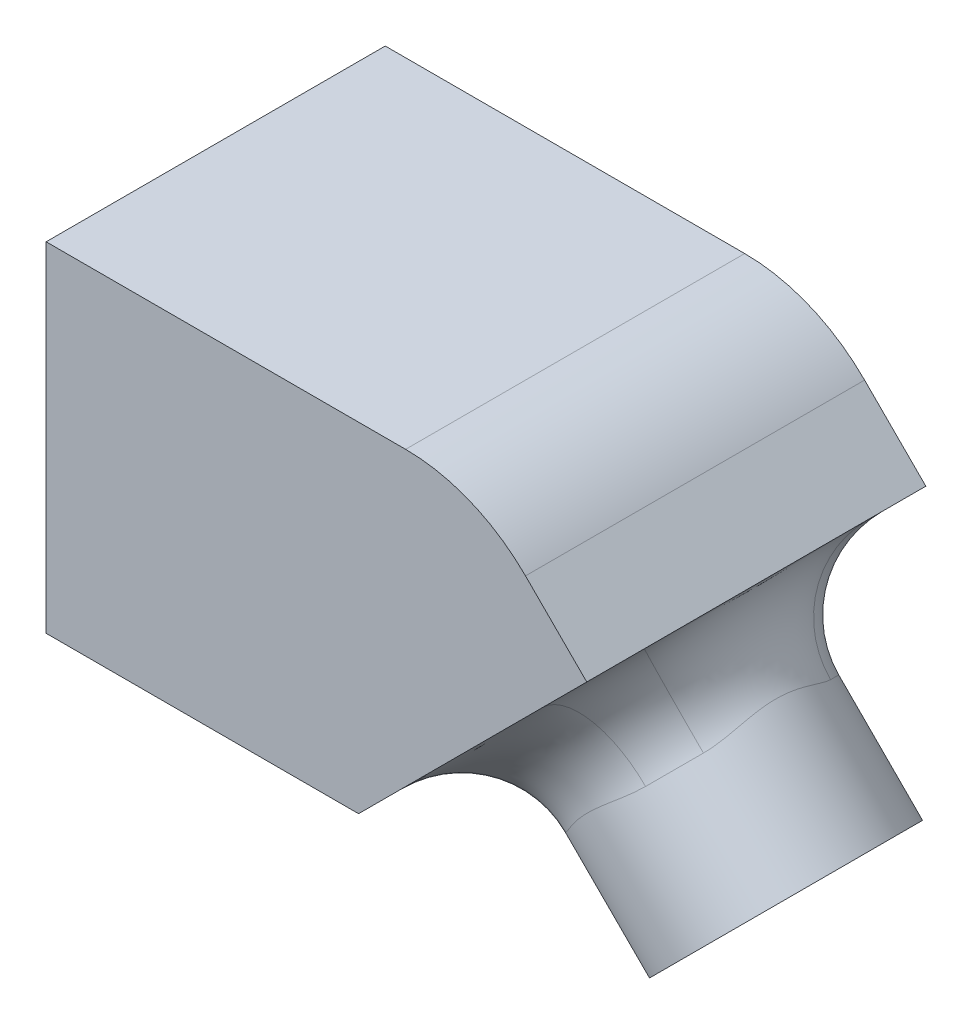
ISO-10303-21;
HEADER;
FILE_DESCRIPTION(('STEP AP214'),'2;1');
FILE_NAME('part.step','',(''),(''),'','','');
FILE_SCHEMA(('AUTOMOTIVE_DESIGN { 1 0 10303 214 1 1 1 1 }'));
ENDSEC;
DATA;
#1=APPLICATION_CONTEXT('core data for automotive mechanical design processes');
#2=APPLICATION_PROTOCOL_DEFINITION('international standard','automotive_design',2000,#1);
#3=PRODUCT_CONTEXT('',#1,'mechanical');
#4=PRODUCT('Part','Part','',(#3));
#5=PRODUCT_RELATED_PRODUCT_CATEGORY('part','',(#4));
#6=PRODUCT_DEFINITION_FORMATION('','',#4);
#7=PRODUCT_DEFINITION_CONTEXT('part definition',#1,'design');
#8=PRODUCT_DEFINITION('design','',#6,#7);
#9=PRODUCT_DEFINITION_SHAPE('','',#8);
#10=(LENGTH_UNIT() NAMED_UNIT(*) SI_UNIT(.MILLI.,.METRE.));
#11=(NAMED_UNIT(*) PLANE_ANGLE_UNIT() SI_UNIT($,.RADIAN.));
#12=(NAMED_UNIT(*) SI_UNIT($,.STERADIAN.) SOLID_ANGLE_UNIT());
#13=UNCERTAINTY_MEASURE_WITH_UNIT(LENGTH_MEASURE(1.E-05),#10,'distance_accuracy_value','');
#14=(GEOMETRIC_REPRESENTATION_CONTEXT(3) GLOBAL_UNCERTAINTY_ASSIGNED_CONTEXT((#13)) GLOBAL_UNIT_ASSIGNED_CONTEXT((#10,
#11,#12)) REPRESENTATION_CONTEXT('',''));
#15=CARTESIAN_POINT('',(0.,0.,0.));
#16=DIRECTION('',(0.,0.,1.));
#17=DIRECTION('',(1.,0.,0.));
#18=AXIS2_PLACEMENT_3D('',#15,#16,#17);
#19=CARTESIAN_POINT('',(31.8849128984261,13.4581516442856,20.));
#20=DIRECTION('',(-0.707106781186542,0.707106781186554,0.));
#21=DIRECTION('',(-0.707106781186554,-0.707106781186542,0.));
#22=AXIS2_PLACEMENT_3D('',#19,#20,#21);
#23=PLANE('',#22);
#24=DIRECTION('',(0.,0.,-1.));
#25=VECTOR('',#24,1.);
#26=CARTESIAN_POINT('',(31.8849128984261,13.4581516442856,20.));
#27=LINE('',#26,#25);
#28=CARTESIAN_POINT('',(31.8849128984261,13.4581516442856,3.40449096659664));
#29=VERTEX_POINT('',#28);
#30=CARTESIAN_POINT('',(31.8849128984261,13.4581516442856,0.));
#31=VERTEX_POINT('',#30);
#32=EDGE_CURVE('E159',#29,#31,#27,.T.);
#33=ORIENTED_EDGE('',*,*,#32,.F.);
#34=CARTESIAN_POINT('',(25.1558370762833,6.72907582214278,10.));
#35=DIRECTION('',(-0.707106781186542,0.707106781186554,0.));
#36=DIRECTION('',(-0.707106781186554,-0.707106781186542,0.));
#37=AXIS2_PLACEMENT_3D('',#34,#35,#36);
#38=CIRCLE('',#37,11.5785);
#39=CARTESIAN_POINT('',(29.2826798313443,10.8559185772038,0.));
#40=VERTEX_POINT('',#39);
#41=EDGE_CURVE('E10',#29,#40,#38,.T.);
#42=ORIENTED_EDGE('',*,*,#41,.T.);
#43=DIRECTION('',(0.707106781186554,0.707106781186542,0.));
#44=VECTOR('',#43,1.);
#45=CARTESIAN_POINT('',(31.8849128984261,13.4581516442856,0.));
#46=LINE('',#45,#44);
#47=EDGE_CURVE('E185',#40,#31,#46,.T.);
#48=ORIENTED_EDGE('',*,*,#47,.T.);
#49=EDGE_LOOP('',(#33,#42,#48));
#50=FACE_BOUND('',#49,.T.);
#51=ADVANCED_FACE('F16',(#50),#23,.F.);
#52=CARTESIAN_POINT('',(18.4267612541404,0.,0.));
#53=VERTEX_POINT('',#52);
#54=CARTESIAN_POINT('',(21.0289943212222,2.60223306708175,0.));
#55=VERTEX_POINT('',#54);
#56=EDGE_CURVE('E182',#53,#55,#46,.T.);
#57=ORIENTED_EDGE('',*,*,#56,.T.);
#58=CARTESIAN_POINT('',(25.1558370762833,6.72907582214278,10.));
#59=DIRECTION('',(-0.707106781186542,0.707106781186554,0.));
#60=DIRECTION('',(-0.707106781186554,-0.707106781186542,0.));
#61=AXIS2_PLACEMENT_3D('',#58,#59,#60);
#62=CIRCLE('',#61,11.5785);
#63=CARTESIAN_POINT('',(18.4267612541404,0.,3.40449096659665));
#64=VERTEX_POINT('',#63);
#65=EDGE_CURVE('E29',#55,#64,#62,.T.);
#66=ORIENTED_EDGE('',*,*,#65,.T.);
#67=DIRECTION('',(0.,0.,-1.));
#68=VECTOR('',#67,1.);
#69=CARTESIAN_POINT('',(18.4267612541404,0.,20.));
#70=LINE('',#69,#68);
#71=EDGE_CURVE('E150',#64,#53,#70,.T.);
#72=ORIENTED_EDGE('',*,*,#71,.T.);
#73=EDGE_LOOP('',(#57,#66,#72));
#74=FACE_BOUND('',#73,.T.);
#75=ADVANCED_FACE('F275',(#74),#23,.F.);
#76=CARTESIAN_POINT('',(18.4267612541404,0.,20.));
#77=VERTEX_POINT('',#76);
#78=CARTESIAN_POINT('',(18.4267612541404,0.,16.5955090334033));
#79=VERTEX_POINT('',#78);
#80=EDGE_CURVE('E125',#77,#79,#70,.T.);
#81=ORIENTED_EDGE('',*,*,#80,.T.);
#82=CARTESIAN_POINT('',(25.1558370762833,6.72907582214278,10.));
#83=DIRECTION('',(-0.707106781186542,0.707106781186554,0.));
#84=DIRECTION('',(-0.707106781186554,-0.707106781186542,0.));
#85=AXIS2_PLACEMENT_3D('',#82,#83,#84);
#86=CIRCLE('',#85,11.5785);
#87=CARTESIAN_POINT('',(21.0289943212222,2.60223306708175,20.));
#88=VERTEX_POINT('',#87);
#89=EDGE_CURVE('E128',#79,#88,#86,.T.);
#90=ORIENTED_EDGE('',*,*,#89,.T.);
#91=DIRECTION('',(0.707106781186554,0.707106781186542,0.));
#92=VECTOR('',#91,1.);
#93=CARTESIAN_POINT('',(31.8849128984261,13.4581516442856,20.));
#94=LINE('',#93,#92);
#95=EDGE_CURVE('E122',#77,#88,#94,.T.);
#96=ORIENTED_EDGE('',*,*,#95,.F.);
#97=EDGE_LOOP('',(#81,#90,#96));
#98=FACE_BOUND('',#97,.T.);
#99=ADVANCED_FACE('F124',(#98),#23,.F.);
#100=CARTESIAN_POINT('',(0.,0.,20.));
#101=DIRECTION('',(0.,1.,0.));
#102=DIRECTION('',(0.,0.,1.));
#103=AXIS2_PLACEMENT_3D('',#100,#101,#102);
#104=PLANE('',#103);
#105=DIRECTION('',(1.,0.,0.));
#106=VECTOR('',#105,1.);
#107=CARTESIAN_POINT('',(0.,0.,0.));
#108=LINE('',#107,#106);
#109=CARTESIAN_POINT('',(0.,0.,0.));
#110=VERTEX_POINT('',#109);
#111=EDGE_CURVE('E186',#110,#53,#108,.T.);
#112=ORIENTED_EDGE('',*,*,#111,.T.);
#113=ORIENTED_EDGE('',*,*,#71,.F.);
#114=EDGE_CURVE('E43',#79,#64,#70,.T.);
#115=ORIENTED_EDGE('',*,*,#114,.F.);
#116=ORIENTED_EDGE('',*,*,#80,.F.);
#117=DIRECTION('',(1.,0.,0.));
#118=VECTOR('',#117,1.);
#119=CARTESIAN_POINT('',(0.,0.,20.));
#120=LINE('',#119,#118);
#121=CARTESIAN_POINT('',(0.,0.,20.));
#122=VERTEX_POINT('',#121);
#123=EDGE_CURVE('E137',#122,#77,#120,.T.);
#124=ORIENTED_EDGE('',*,*,#123,.F.);
#125=DIRECTION('',(0.,0.,-1.));
#126=VECTOR('',#125,1.);
#127=CARTESIAN_POINT('',(0.,0.,20.));
#128=LINE('',#127,#126);
#129=EDGE_CURVE('E171',#122,#110,#128,.T.);
#130=ORIENTED_EDGE('',*,*,#129,.T.);
#131=EDGE_LOOP('',(#112,#113,#115,#116,#124,#130));
#132=FACE_BOUND('',#131,.T.);
#133=ADVANCED_FACE('F147',(#132),#104,.F.);
#134=CARTESIAN_POINT('',(29.2826798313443,10.8559185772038,20.));
#135=VERTEX_POINT('',#134);
#136=CARTESIAN_POINT('',(31.8849128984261,13.4581516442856,20.));
#137=VERTEX_POINT('',#136);
#138=EDGE_CURVE('E135',#135,#137,#94,.T.);
#139=ORIENTED_EDGE('',*,*,#138,.F.);
#140=CARTESIAN_POINT('',(25.1558370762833,6.72907582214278,10.));
#141=DIRECTION('',(-0.707106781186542,0.707106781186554,0.));
#142=DIRECTION('',(-0.707106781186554,-0.707106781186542,0.));
#143=AXIS2_PLACEMENT_3D('',#140,#141,#142);
#144=CIRCLE('',#143,11.5785);
#145=CARTESIAN_POINT('',(31.8849128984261,13.4581516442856,16.5955090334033));
#146=VERTEX_POINT('',#145);
#147=EDGE_CURVE('E495',#135,#146,#144,.T.);
#148=ORIENTED_EDGE('',*,*,#147,.T.);
#149=EDGE_CURVE('E155',#137,#146,#27,.T.);
#150=ORIENTED_EDGE('',*,*,#149,.F.);
#151=EDGE_LOOP('',(#139,#148,#150));
#152=FACE_BOUND('',#151,.T.);
#153=ADVANCED_FACE('F218',(#152),#23,.F.);
#154=CARTESIAN_POINT('',(25.3430645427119,20.,20.));
#155=DIRECTION('',(-0.707106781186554,-0.707106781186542,0.));
#156=DIRECTION('',(0.707106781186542,-0.707106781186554,0.));
#157=AXIS2_PLACEMENT_3D('',#154,#155,#156);
#158=PLANE('',#157);
#159=DIRECTION('',(-0.707106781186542,0.707106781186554,0.));
#160=VECTOR('',#159,1.);
#161=CARTESIAN_POINT('',(25.3430645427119,20.,0.));
#162=LINE('',#161,#160);
#163=CARTESIAN_POINT('',(28.2719967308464,17.0710678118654,0.));
#164=VERTEX_POINT('',#163);
#165=EDGE_CURVE('E180',#31,#164,#162,.T.);
#166=ORIENTED_EDGE('',*,*,#165,.T.);
#167=DIRECTION('',(0.,0.,-1.));
#168=VECTOR('',#167,1.);
#169=CARTESIAN_POINT('',(28.2719967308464,17.0710678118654,20.));
#170=LINE('',#169,#168);
#171=CARTESIAN_POINT('',(28.2719967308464,17.0710678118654,20.));
#172=VERTEX_POINT('',#171);
#173=EDGE_CURVE('E532',#164,#172,#170,.F.);
#174=ORIENTED_EDGE('',*,*,#173,.T.);
#175=DIRECTION('',(-0.707106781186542,0.707106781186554,0.));
#176=VECTOR('',#175,1.);
#177=CARTESIAN_POINT('',(25.3430645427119,20.,20.));
#178=LINE('',#177,#176);
#179=EDGE_CURVE('E132',#137,#172,#178,.T.);
#180=ORIENTED_EDGE('',*,*,#179,.F.);
#181=ORIENTED_EDGE('',*,*,#149,.T.);
#182=EDGE_CURVE('E158',#146,#29,#27,.T.);
#183=ORIENTED_EDGE('',*,*,#182,.T.);
#184=ORIENTED_EDGE('',*,*,#32,.T.);
#185=EDGE_LOOP('',(#166,#174,#180,#181,#183,#184));
#186=FACE_BOUND('',#185,.T.);
#187=ADVANCED_FACE('F282',(#186),#158,.F.);
#188=CARTESIAN_POINT('',(0.,20.,20.));
#189=DIRECTION('',(0.,-1.,0.));
#190=DIRECTION('',(0.,0.,-1.));
#191=AXIS2_PLACEMENT_3D('',#188,#189,#190);
#192=PLANE('',#191);
#193=DIRECTION('',(-1.,0.,0.));
#194=VECTOR('',#193,1.);
#195=CARTESIAN_POINT('',(0.,20.,20.));
#196=LINE('',#195,#194);
#197=CARTESIAN_POINT('',(21.2009289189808,20.,20.));
#198=VERTEX_POINT('',#197);
#199=CARTESIAN_POINT('',(0.,20.,20.));
#200=VERTEX_POINT('',#199);
#201=EDGE_CURVE('E190',#198,#200,#196,.T.);
#202=ORIENTED_EDGE('',*,*,#201,.F.);
#203=DIRECTION('',(0.,0.,-1.));
#204=VECTOR('',#203,1.);
#205=CARTESIAN_POINT('',(21.2009289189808,20.,20.));
#206=LINE('',#205,#204);
#207=CARTESIAN_POINT('',(21.2009289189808,20.,0.));
#208=VERTEX_POINT('',#207);
#209=EDGE_CURVE('E148',#198,#208,#206,.T.);
#210=ORIENTED_EDGE('',*,*,#209,.T.);
#211=DIRECTION('',(-1.,0.,0.));
#212=VECTOR('',#211,1.);
#213=CARTESIAN_POINT('',(0.,20.,0.));
#214=LINE('',#213,#212);
#215=CARTESIAN_POINT('',(0.,20.,0.));
#216=VERTEX_POINT('',#215);
#217=EDGE_CURVE('E178',#208,#216,#214,.T.);
#218=ORIENTED_EDGE('',*,*,#217,.T.);
#219=DIRECTION('',(0.,0.,-1.));
#220=VECTOR('',#219,1.);
#221=CARTESIAN_POINT('',(0.,20.,20.));
#222=LINE('',#221,#220);
#223=EDGE_CURVE('E166',#200,#216,#222,.T.);
#224=ORIENTED_EDGE('',*,*,#223,.F.);
#225=EDGE_LOOP('',(#202,#210,#218,#224));
#226=FACE_BOUND('',#225,.T.);
#227=ADVANCED_FACE('F288',(#226),#192,.F.);
#228=CARTESIAN_POINT('',(0.,0.,20.));
#229=DIRECTION('',(1.,0.,0.));
#230=DIRECTION('',(0.,0.,-1.));
#231=AXIS2_PLACEMENT_3D('',#228,#229,#230);
#232=PLANE('',#231);
#233=DIRECTION('',(0.,-1.,0.));
#234=VECTOR('',#233,1.);
#235=CARTESIAN_POINT('',(0.,0.,0.));
#236=LINE('',#235,#234);
#237=EDGE_CURVE('E144',#216,#110,#236,.T.);
#238=ORIENTED_EDGE('',*,*,#237,.T.);
#239=ORIENTED_EDGE('',*,*,#129,.F.);
#240=DIRECTION('',(0.,-1.,0.));
#241=VECTOR('',#240,1.);
#242=CARTESIAN_POINT('',(0.,0.,20.));
#243=LINE('',#242,#241);
#244=EDGE_CURVE('E141',#200,#122,#243,.T.);
#245=ORIENTED_EDGE('',*,*,#244,.F.);
#246=ORIENTED_EDGE('',*,*,#223,.T.);
#247=EDGE_LOOP('',(#238,#239,#245,#246));
#248=FACE_BOUND('',#247,.T.);
#249=ADVANCED_FACE('F362',(#248),#232,.F.);
#250=CARTESIAN_POINT('',(0.,0.,20.));
#251=DIRECTION('',(0.,0.,1.));
#252=DIRECTION('',(1.,0.,0.));
#253=AXIS2_PLACEMENT_3D('',#250,#251,#252);
#254=PLANE('',#253);
#255=ORIENTED_EDGE('',*,*,#179,.T.);
#256=CARTESIAN_POINT('',(21.2009289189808,10.,20.));
#257=DIRECTION('',(0.,0.,1.));
#258=DIRECTION('',(1.,0.,0.));
#259=AXIS2_PLACEMENT_3D('',#256,#257,#258);
#260=CIRCLE('',#259,10.);
#261=EDGE_CURVE('E530',#172,#198,#260,.T.);
#262=ORIENTED_EDGE('',*,*,#261,.T.);
#263=ORIENTED_EDGE('',*,*,#201,.T.);
#264=ORIENTED_EDGE('',*,*,#244,.T.);
#265=ORIENTED_EDGE('',*,*,#123,.T.);
#266=ORIENTED_EDGE('',*,*,#95,.T.);
#267=EDGE_CURVE('E133',#88,#135,#94,.T.);
#268=ORIENTED_EDGE('',*,*,#267,.T.);
#269=ORIENTED_EDGE('',*,*,#138,.T.);
#270=EDGE_LOOP('',(#255,#262,#263,#264,#265,#266,#268,#269));
#271=FACE_BOUND('',#270,.T.);
#272=ADVANCED_FACE('F139',(#271),#254,.T.);
#273=CARTESIAN_POINT('',(0.,0.,0.));
#274=DIRECTION('',(0.,0.,1.));
#275=DIRECTION('',(1.,0.,0.));
#276=AXIS2_PLACEMENT_3D('',#273,#274,#275);
#277=PLANE('',#276);
#278=ORIENTED_EDGE('',*,*,#217,.F.);
#279=CARTESIAN_POINT('',(21.2009289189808,10.,0.));
#280=DIRECTION('',(0.,0.,1.));
#281=DIRECTION('',(1.,0.,0.));
#282=AXIS2_PLACEMENT_3D('',#279,#280,#281);
#283=CIRCLE('',#282,10.);
#284=EDGE_CURVE('E152',#208,#164,#283,.F.);
#285=ORIENTED_EDGE('',*,*,#284,.T.);
#286=ORIENTED_EDGE('',*,*,#165,.F.);
#287=ORIENTED_EDGE('',*,*,#47,.F.);
#288=EDGE_CURVE('E184',#55,#40,#46,.T.);
#289=ORIENTED_EDGE('',*,*,#288,.F.);
#290=ORIENTED_EDGE('',*,*,#56,.F.);
#291=ORIENTED_EDGE('',*,*,#111,.F.);
#292=ORIENTED_EDGE('',*,*,#237,.F.);
#293=EDGE_LOOP('',(#278,#285,#286,#287,#289,#290,#291,#292));
#294=FACE_BOUND('',#293,.T.);
#295=ADVANCED_FACE('F377',(#294),#277,.F.);
#296=CARTESIAN_POINT('',(33.6411184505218,-1.75620555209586,10.));
#297=DIRECTION('',(-0.707106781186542,0.707106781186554,0.));
#298=DIRECTION('',(-0.707106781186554,-0.707106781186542,0.));
#299=AXIS2_PLACEMENT_3D('',#296,#297,#298);
#300=CYLINDRICAL_SURFACE('',#299,6.5785);
#301=CARTESIAN_POINT('',(28.6913709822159,3.19354191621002,10.));
#302=DIRECTION('',(-0.707106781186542,0.707106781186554,0.));
#303=DIRECTION('',(-0.707106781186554,-0.707106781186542,0.));
#304=AXIS2_PLACEMENT_3D('',#301,#302,#303);
#305=CIRCLE('',#304,6.5785);
#306=CARTESIAN_POINT('',(31.0360991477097,5.53827008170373,4.31834866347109));
#307=VERTEX_POINT('',#306);
#308=CARTESIAN_POINT('',(32.5145972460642,7.0167681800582,6.25266172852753));
#309=VERTEX_POINT('',#308);
#310=EDGE_CURVE('E528',#307,#309,#305,.F.);
#311=ORIENTED_EDGE('',*,*,#310,.T.);
#312=CARTESIAN_POINT('',(31.4553507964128,6.51391734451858,5.02335726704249));
#313=CARTESIAN_POINT('',(28.1422721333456,11.9369837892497,6.31317410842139));
#314=CARTESIAN_POINT('',(31.8849128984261,13.4581516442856,1.24085157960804));
#315=CARTESIAN_POINT('',(31.5530228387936,6.52833704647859,5.09183878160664));
#316=CARTESIAN_POINT('',(28.1393721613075,11.8047874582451,6.27187725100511));
#317=CARTESIAN_POINT('',(31.8849128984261,13.4581516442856,1.36138258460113));
#318=CARTESIAN_POINT('',(31.6446218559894,6.54790509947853,5.16313861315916));
#319=CARTESIAN_POINT('',(28.1539135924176,11.677364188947,6.23527735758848));
#320=CARTESIAN_POINT('',(31.8849128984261,13.4581516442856,1.48687397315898));
#321=CARTESIAN_POINT('',(31.8160510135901,6.59546317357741,5.31068126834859));
#322=CARTESIAN_POINT('',(28.2110889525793,11.4389015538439,6.1761186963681));
#323=CARTESIAN_POINT('',(31.8849128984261,13.4581516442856,1.74655667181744));
#324=CARTESIAN_POINT('',(31.8959021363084,6.62343790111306,5.38691492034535));
#325=CARTESIAN_POINT('',(28.2531040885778,11.3276873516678,6.15331069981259));
#326=CARTESIAN_POINT('',(31.8849128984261,13.4581516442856,1.88073183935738));
#327=CARTESIAN_POINT('',(32.0438199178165,6.68568768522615,5.54309971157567));
#328=CARTESIAN_POINT('',(28.3572098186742,11.125590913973,6.12472786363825));
#329=CARTESIAN_POINT('',(31.8849128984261,13.4581516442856,2.15562514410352));
#330=CARTESIAN_POINT('',(32.1119962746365,6.71989704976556,5.62300613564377));
#331=CARTESIAN_POINT('',(28.4186609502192,11.0342434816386,6.11847982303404));
#332=CARTESIAN_POINT('',(31.8849128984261,13.4581516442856,2.29626458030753));
#333=CARTESIAN_POINT('',(32.2383397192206,6.79319752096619,5.78677842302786));
#334=CARTESIAN_POINT('',(28.5545264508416,10.8707649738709,6.12347769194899));
#335=CARTESIAN_POINT('',(31.8849128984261,13.4581516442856,2.58451227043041));
#336=CARTESIAN_POINT('',(32.2965009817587,6.83229144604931,5.87064655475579));
#337=CARTESIAN_POINT('',(28.6286875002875,10.7982951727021,6.13439972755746));
#338=CARTESIAN_POINT('',(31.8849128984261,13.4581516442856,2.73212451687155));
#339=CARTESIAN_POINT('',(32.4274078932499,6.93196736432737,6.07987116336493));
#340=CARTESIAN_POINT('',(28.8174604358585,10.6440939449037,6.18219529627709));
#341=CARTESIAN_POINT('',(31.8849128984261,13.4581516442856,3.1003706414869));
#342=CARTESIAN_POINT('',(32.4951769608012,6.9943881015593,6.20712716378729));
#343=CARTESIAN_POINT('',(28.9362783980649,10.5707044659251,6.22791410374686));
#344=CARTESIAN_POINT('',(31.8849128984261,13.4581516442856,3.32434777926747));
#345=CARTESIAN_POINT('',(32.6142997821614,7.1223583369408,6.46781045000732));
#346=CARTESIAN_POINT('',(29.1742248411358,10.4557437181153,6.35289919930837));
#347=CARTESIAN_POINT('',(31.8849128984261,13.4581516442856,3.78316383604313));
#348=CARTESIAN_POINT('',(32.6656483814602,7.18790881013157,6.60123965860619));
#349=CARTESIAN_POINT('',(29.293499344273,10.4133197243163,6.4314253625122));
#350=CARTESIAN_POINT('',(31.8849128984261,13.4581516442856,4.01800613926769));
#351=CARTESIAN_POINT('',(32.7548607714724,7.31908562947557,6.87408611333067));
#352=CARTESIAN_POINT('',(29.5240680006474,10.3523530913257,6.61790402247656));
#353=CARTESIAN_POINT('',(31.8849128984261,13.4581516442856,4.49823000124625));
#354=CARTESIAN_POINT('',(32.7926536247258,7.38471062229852,7.01353070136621));
#355=CARTESIAN_POINT('',(29.6357457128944,10.3333280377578,6.72553882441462));
#356=CARTESIAN_POINT('',(31.8849128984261,13.4581516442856,4.74365968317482));
#357=CARTESIAN_POINT('',(32.8569963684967,7.51267158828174,7.29706497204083));
#358=CARTESIAN_POINT('',(29.8452867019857,10.312022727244,6.96522229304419));
#359=CARTESIAN_POINT('',(31.8849128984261,13.4581516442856,5.24269465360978));
#360=CARTESIAN_POINT('',(32.8835446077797,7.57500707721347,7.44115533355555));
#361=CARTESIAN_POINT('',(29.9436671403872,10.309389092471,7.09707395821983));
#362=CARTESIAN_POINT('',(31.8849128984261,13.4581516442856,5.49630113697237));
#363=CARTESIAN_POINT('',(32.9287557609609,7.69616392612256,7.73955719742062));
#364=CARTESIAN_POINT('',(30.1277019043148,10.3143690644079,7.38649808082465));
#365=CARTESIAN_POINT('',(31.8849128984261,13.4581516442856,6.02150383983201));
#366=CARTESIAN_POINT('',(32.9470365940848,7.75472420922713,7.89404303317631));
#367=CARTESIAN_POINT('',(30.2132805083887,10.3222422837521,7.54508131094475));
#368=CARTESIAN_POINT('',(31.8849128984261,13.4581516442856,6.2934068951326));
#369=CARTESIAN_POINT('',(32.9764966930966,7.86247887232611,8.20672400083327));
#370=CARTESIAN_POINT('',(30.3652454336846,10.3428225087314,7.87898471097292));
#371=CARTESIAN_POINT('',(31.8849128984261,13.4581516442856,6.84374155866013));
#372=CARTESIAN_POINT('',(32.9876758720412,7.91167313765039,8.36491917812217));
#373=CARTESIAN_POINT('',(30.4321415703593,10.3554933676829,8.05459142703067));
#374=CARTESIAN_POINT('',(31.8849128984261,13.4581516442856,7.12217324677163));
#375=CARTESIAN_POINT('',(33.0050667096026,7.99809447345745,8.68388996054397));
#376=CARTESIAN_POINT('',(30.5463150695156,10.3807554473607,8.41761732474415));
#377=CARTESIAN_POINT('',(31.8849128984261,13.4581516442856,7.68357830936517));
#378=CARTESIAN_POINT('',(33.0112909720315,8.03535176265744,8.84465795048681));
#379=CARTESIAN_POINT('',(30.5940375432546,10.3933888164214,8.60547089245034));
#380=CARTESIAN_POINT('',(31.8849128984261,13.4581516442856,7.9665382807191));
#381=CARTESIAN_POINT('',(33.0205165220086,8.09605511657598,9.16831478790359));
#382=CARTESIAN_POINT('',(30.6702518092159,10.4150818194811,8.98909860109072));
#383=CARTESIAN_POINT('',(31.8849128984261,13.4581516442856,8.53619104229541));
#384=CARTESIAN_POINT('',(33.0235177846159,8.11950107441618,9.33120365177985));
#385=CARTESIAN_POINT('',(30.6990145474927,10.42420484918,9.18548012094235));
#386=CARTESIAN_POINT('',(31.8849128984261,13.4581516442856,8.82288386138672));
#387=CARTESIAN_POINT('',(33.0276368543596,8.15293841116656,9.67591898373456));
#388=CARTESIAN_POINT('',(30.7396438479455,10.4373640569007,9.60341938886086));
#389=CARTESIAN_POINT('',(31.8849128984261,13.4581516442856,9.42960066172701));
#390=CARTESIAN_POINT('',(33.0285141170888,8.161187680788,9.85787704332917));
#391=CARTESIAN_POINT('',(30.7495173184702,10.4407971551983,9.82638370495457));
#392=CARTESIAN_POINT('',(31.8849128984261,13.4581516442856,9.74985625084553));
#393=CARTESIAN_POINT('',(33.0281966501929,8.15839492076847,10.2216920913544));
#394=CARTESIAN_POINT('',(30.7461617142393,10.4396654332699,10.270914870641));
#395=CARTESIAN_POINT('',(31.8849128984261,13.4581516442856,10.3901895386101));
#396=CARTESIAN_POINT('',(33.0270017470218,8.14735127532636,10.4035490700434));
#397=CARTESIAN_POINT('',(30.7329157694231,10.4350948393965,10.4934697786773));
#398=CARTESIAN_POINT('',(31.8849128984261,13.4581516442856,10.7102672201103));
#399=CARTESIAN_POINT('',(33.0218680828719,8.10674102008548,10.7660996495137));
#400=CARTESIAN_POINT('',(30.6833704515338,10.4192702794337,10.9319732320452));
#401=CARTESIAN_POINT('',(31.8849128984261,13.4581516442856,11.3483749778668));
#402=CARTESIAN_POINT('',(33.0179227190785,8.07712985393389,10.9467893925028));
#403=CARTESIAN_POINT('',(30.6467955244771,10.4079332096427,11.1488400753));
#404=CARTESIAN_POINT('',(31.8849128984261,13.4581516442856,11.6663982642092));
#405=CARTESIAN_POINT('',(33.0055544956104,8.00143204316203,11.3052378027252));
#406=CARTESIAN_POINT('',(30.550577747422,10.3819986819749,11.5698230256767));
#407=CARTESIAN_POINT('',(31.8849128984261,13.4581516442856,12.2972859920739));
#408=CARTESIAN_POINT('',(32.9971315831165,7.955345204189,11.4829964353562));
#409=CARTESIAN_POINT('',(30.4905133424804,10.3673150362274,11.7747288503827));
#410=CARTESIAN_POINT('',(31.8849128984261,13.4581516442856,12.6101503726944));
#411=CARTESIAN_POINT('',(32.9738417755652,7.85232738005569,11.8257688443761));
#412=CARTESIAN_POINT('',(30.3512037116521,10.3407257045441,12.156470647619));
#413=CARTESIAN_POINT('',(31.8849128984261,13.4581516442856,13.2134475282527));
#414=CARTESIAN_POINT('',(32.9593147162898,7.79604657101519,11.9909777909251));
#415=CARTESIAN_POINT('',(30.27247856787,10.3286857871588,12.3348053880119));
#416=CARTESIAN_POINT('',(31.8849128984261,13.4581516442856,13.5042238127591));
#417=CARTESIAN_POINT('',(32.9212048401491,7.67440858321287,12.316950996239));
#418=CARTESIAN_POINT('',(30.0953764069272,10.3125974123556,12.6701680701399));
#419=CARTESIAN_POINT('',(31.8849128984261,13.4581516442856,14.0779535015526));
#420=CARTESIAN_POINT('',(32.8976222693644,7.60905165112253,12.4777153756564));
#421=CARTESIAN_POINT('',(29.9963570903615,10.3086568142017,12.8274174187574));
#422=CARTESIAN_POINT('',(31.8849128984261,13.4581516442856,14.3609071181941));
#423=CARTESIAN_POINT('',(32.8384566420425,7.47297150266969,12.7934123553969));
#424=CARTESIAN_POINT('',(29.7814982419,10.316282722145,13.1148310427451));
#425=CARTESIAN_POINT('',(31.8849128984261,13.4581516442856,14.9165501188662));
#426=CARTESIAN_POINT('',(32.8029201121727,7.40226990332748,12.9483650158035));
#427=CARTESIAN_POINT('',(29.6650234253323,10.3281237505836,13.2450071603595));
#428=CARTESIAN_POINT('',(31.8849128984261,13.4581516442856,15.1892748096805));
#429=CARTESIAN_POINT('',(32.7165053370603,7.2590707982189,13.2522129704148));
#430=CARTESIAN_POINT('',(29.4199544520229,10.3760235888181,13.4734554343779));
#431=CARTESIAN_POINT('',(31.8849128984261,13.4581516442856,15.7240629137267));
#432=CARTESIAN_POINT('',(32.6656312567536,7.18657378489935,13.401109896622));
#433=CARTESIAN_POINT('',(29.290740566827,10.412734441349,13.571255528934));
#434=CARTESIAN_POINT('',(31.8849128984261,13.4581516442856,15.9861291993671));
#435=CARTESIAN_POINT('',(32.5642177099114,7.06680178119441,13.6454645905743));
#436=CARTESIAN_POINT('',(29.0721546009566,10.5024292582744,13.7037409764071));
#437=CARTESIAN_POINT('',(31.8849128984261,13.4581516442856,16.4162060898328));
#438=CARTESIAN_POINT('',(32.518731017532,7.01884690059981,13.7428401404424));
#439=CARTESIAN_POINT('',(28.9824312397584,10.5471737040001,13.7486534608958));
#440=CARTESIAN_POINT('',(31.8849128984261,13.4581516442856,16.5875920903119));
#441=CARTESIAN_POINT('',(32.4178506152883,6.92568948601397,13.9338175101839));
#442=CARTESIAN_POINT('',(28.8063856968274,10.6553104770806,13.8195985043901));
#443=CARTESIAN_POINT('',(31.8849128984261,13.4581516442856,16.9237221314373));
#444=CARTESIAN_POINT('',(32.3624624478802,6.88048543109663,14.0274214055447));
#445=CARTESIAN_POINT('',(28.7200819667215,10.7190970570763,13.8452811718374));
#446=CARTESIAN_POINT('',(31.8849128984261,13.4581516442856,17.0884698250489));
#447=CARTESIAN_POINT('',(32.240190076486,6.7942251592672,14.2110450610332));
#448=CARTESIAN_POINT('',(28.5564676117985,10.8682499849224,13.87695307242));
#449=CARTESIAN_POINT('',(31.8849128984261,13.4581516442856,17.4116569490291));
#450=CARTESIAN_POINT('',(32.1732290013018,6.7531997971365,14.3010355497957));
#451=CARTESIAN_POINT('',(28.4794332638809,10.9542100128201,13.8823790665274));
#452=CARTESIAN_POINT('',(31.8849128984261,13.4581516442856,17.5700448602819));
#453=CARTESIAN_POINT('',(32.0269097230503,6.67761336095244,14.4762784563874));
#454=CARTESIAN_POINT('',(28.3429633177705,11.1481493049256,13.8737386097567));
#455=CARTESIAN_POINT('',(31.8849128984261,13.4581516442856,17.8784814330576));
#456=CARTESIAN_POINT('',(31.9475311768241,6.64306310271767,14.561522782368));
#457=CARTESIAN_POINT('',(28.2839803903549,11.2565886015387,13.8592173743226));
#458=CARTESIAN_POINT('',(31.8849128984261,13.4581516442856,18.0285158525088));
#459=CARTESIAN_POINT('',(31.8614677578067,6.6128020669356,14.6440122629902));
#460=CARTESIAN_POINT('',(28.2390328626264,11.3748071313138,13.8355481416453));
#461=CARTESIAN_POINT('',(31.8849128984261,13.4581516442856,18.1737016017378));
#462=(BOUNDED_SURFACE() B_SPLINE_SURFACE(3,2,((#312,#313,#314),(#315,#316,#317),(#318,#319,
#320),(#321,#322,#323),(#324,#325,#326),(#327,#328,#329),(#330,#331,#332),(#333,#334,#335),
(#336,#337,#338),(#339,#340,#341),(#342,#343,#344),(#345,#346,#347),(#348,#349,#350),(#351,#352,
#353),(#354,#355,#356),(#357,#358,#359),(#360,#361,#362),(#363,#364,#365),(#366,#367,#368),
(#369,#370,#371),(#372,#373,#374),(#375,#376,#377),(#378,#379,#380),(#381,#382,#383),(#384,#385,
#386),(#387,#388,#389),(#390,#391,#392),(#393,#394,#395),(#396,#397,#398),(#399,#400,#401),
(#402,#403,#404),(#405,#406,#407),(#408,#409,#410),(#411,#412,#413),(#414,#415,#416),(#417,#418,
#419),(#420,#421,#422),(#423,#424,#425),(#426,#427,#428),(#429,#430,#431),(#432,#433,#434),
(#435,#436,#437),(#438,#439,#440),(#441,#442,#443),(#444,#445,#446),(#447,#448,#449),(#450,#451,
#452),(#453,#454,#455),(#456,#457,#458),(#459,#460,#461)),.UNSPECIFIED.,.F.,.F.,
.F.) B_SPLINE_SURFACE_WITH_KNOTS((4,2,2,2,2,2,2,2,2,2,2,2,2,2,2,2,2,2,2,2,2,2,2,2,4),(3,3),(0.,
0.580144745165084,1.15924040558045,1.73255428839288,2.30620051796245,3.13433459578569,
3.96272837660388,4.79539599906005,5.62818585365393,6.49628728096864,7.36439933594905,
8.23029605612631,9.09619947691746,10.0563463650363,11.0165736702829,11.9791140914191,
12.9416658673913,13.8565421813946,14.7713936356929,15.6827247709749,16.5938086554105,
17.2147530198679,17.8353508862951,18.4602416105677,19.0861670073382),(0.,1.),
.UNSPECIFIED.) GEOMETRIC_REPRESENTATION_ITEM() RATIONAL_B_SPLINE_SURFACE(((1.,0.610620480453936,
1.),(1.,0.616169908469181,1.),(1.,0.622017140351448,1.),(1.,0.634117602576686,1.),(1.,
0.640370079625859,1.),(1.,0.653049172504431,1.),(1.,0.65947342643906,1.),(1.,0.672401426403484,
1.),(1.,0.678905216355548,1.),(1.,0.694724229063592,1.),(1.,0.704006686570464,1.),(1.,
0.722108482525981,1.),(1.,0.730927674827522,1.),(1.,0.747895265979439,1.),(1.,0.75603996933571,
1.),(1.,0.771417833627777,1.),(1.,0.778650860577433,1.),(1.,0.792343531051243,1.),(1.,
0.798757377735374,1.),(1.,0.810307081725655,1.),(1.,0.815442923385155,1.),(1.,0.824323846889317,
1.),(1.,0.828072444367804,1.),(1.,0.834120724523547,1.),(1.,0.836420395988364,1.),(1.,
0.839689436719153,1.),(1.,0.840486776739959,1.),(1.,0.840215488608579,1.),(1.,0.839146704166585,
1.),(1.,0.83516779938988,1.),(1.,0.832253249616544,1.),(1.,0.82465545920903,1.),(1.,
0.819972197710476,1.),(1.,0.809226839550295,1.),(1.,0.803244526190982,1.),(1.,0.789918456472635,
1.),(1.,0.782574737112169,1.),(1.,0.766725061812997,1.),(1.,0.758223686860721,1.),(1.,
0.740257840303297,1.),(1.,0.730793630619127,1.),(1.,0.714327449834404,1.),(1.,0.707501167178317,
1.),(1.,0.693672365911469,1.),(1.,0.686669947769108,1.),(1.,0.672588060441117,1.),(1.,
0.665508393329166,1.),(1.,0.651500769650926,1.),(1.,0.644573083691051,1.),(1.,0.637823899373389,1.))) REPRESENTATION_ITEM('') SURFACE());
#463=CARTESIAN_POINT('',(31.4553507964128,6.51391734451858,5.02335726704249));
#464=CARTESIAN_POINT('',(31.5530228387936,6.52833704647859,5.09183878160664));
#465=CARTESIAN_POINT('',(31.6446218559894,6.54790509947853,5.16313861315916));
#466=CARTESIAN_POINT('',(31.8160510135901,6.59546317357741,5.31068126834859));
#467=CARTESIAN_POINT('',(31.8959021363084,6.62343790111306,5.38691492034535));
#468=CARTESIAN_POINT('',(32.0438199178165,6.68568768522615,5.54309971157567));
#469=CARTESIAN_POINT('',(32.1119962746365,6.71989704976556,5.62300613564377));
#470=CARTESIAN_POINT('',(32.2383397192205,6.79319752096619,5.78677842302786));
#471=CARTESIAN_POINT('',(32.2965009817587,6.83229144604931,5.87064655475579));
#472=CARTESIAN_POINT('',(32.4274078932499,6.93196736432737,6.07987116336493));
#473=CARTESIAN_POINT('',(32.4951769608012,6.9943881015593,6.20712716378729));
#474=CARTESIAN_POINT('',(32.6142997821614,7.1223583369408,6.46781045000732));
#475=CARTESIAN_POINT('',(32.6656483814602,7.18790881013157,6.60123965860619));
#476=CARTESIAN_POINT('',(32.7548607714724,7.31908562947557,6.87408611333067));
#477=CARTESIAN_POINT('',(32.7926536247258,7.38471062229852,7.01353070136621));
#478=CARTESIAN_POINT('',(32.8569963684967,7.51267158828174,7.29706497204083));
#479=CARTESIAN_POINT('',(32.8835446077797,7.57500707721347,7.44115533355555));
#480=CARTESIAN_POINT('',(32.9287557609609,7.69616392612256,7.73955719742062));
#481=CARTESIAN_POINT('',(32.9470365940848,7.75472420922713,7.89404303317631));
#482=CARTESIAN_POINT('',(32.9764966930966,7.86247887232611,8.20672400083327));
#483=CARTESIAN_POINT('',(32.9876758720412,7.91167313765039,8.36491917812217));
#484=CARTESIAN_POINT('',(33.0050667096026,7.99809447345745,8.68388996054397));
#485=CARTESIAN_POINT('',(33.0112909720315,8.03535176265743,8.8446579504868));
#486=CARTESIAN_POINT('',(33.0205165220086,8.09605511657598,9.16831478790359));
#487=CARTESIAN_POINT('',(33.0235177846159,8.11950107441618,9.33120365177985));
#488=CARTESIAN_POINT('',(33.0276368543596,8.15293841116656,9.67591898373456));
#489=CARTESIAN_POINT('',(33.0285141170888,8.161187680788,9.85787704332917));
#490=CARTESIAN_POINT('',(33.0281966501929,8.15839492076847,10.2216920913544));
#491=CARTESIAN_POINT('',(33.0270017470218,8.14735127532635,10.4035490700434));
#492=CARTESIAN_POINT('',(33.0218680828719,8.10674102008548,10.7660996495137));
#493=CARTESIAN_POINT('',(33.0179227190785,8.07712985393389,10.9467893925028));
#494=CARTESIAN_POINT('',(33.0055544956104,8.00143204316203,11.3052378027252));
#495=CARTESIAN_POINT('',(32.9971315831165,7.955345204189,11.4829964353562));
#496=CARTESIAN_POINT('',(32.9738417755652,7.85232738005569,11.8257688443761));
#497=CARTESIAN_POINT('',(32.9593147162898,7.79604657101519,11.9909777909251));
#498=CARTESIAN_POINT('',(32.9212048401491,7.67440858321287,12.316950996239));
#499=CARTESIAN_POINT('',(32.8976222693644,7.60905165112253,12.4777153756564));
#500=CARTESIAN_POINT('',(32.8384566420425,7.47297150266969,12.7934123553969));
#501=CARTESIAN_POINT('',(32.8029201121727,7.40226990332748,12.9483650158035));
#502=CARTESIAN_POINT('',(32.7165053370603,7.2590707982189,13.2522129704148));
#503=CARTESIAN_POINT('',(32.6656312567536,7.18657378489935,13.401109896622));
#504=CARTESIAN_POINT('',(32.5642177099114,7.06680178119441,13.6454645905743));
#505=CARTESIAN_POINT('',(32.518731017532,7.01884690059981,13.7428401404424));
#506=CARTESIAN_POINT('',(32.4178506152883,6.92568948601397,13.9338175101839));
#507=CARTESIAN_POINT('',(32.3624624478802,6.88048543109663,14.0274214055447));
#508=CARTESIAN_POINT('',(32.240190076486,6.7942251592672,14.2110450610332));
#509=CARTESIAN_POINT('',(32.1732290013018,6.7531997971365,14.3010355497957));
#510=CARTESIAN_POINT('',(32.0269097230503,6.67761336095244,14.4762784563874));
#511=CARTESIAN_POINT('',(31.9475311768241,6.64306310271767,14.561522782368));
#512=CARTESIAN_POINT('',(31.8614677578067,6.6128020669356,14.6440122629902));
#513=B_SPLINE_CURVE_WITH_KNOTS('',3,(#463,#464,#465,#466,#467,#468,#469,#470,#471,#472,#473,
#474,#475,#476,#477,#478,#479,#480,#481,#482,#483,#484,#485,#486,#487,#488,#489,#490,#491,#492,
#493,#494,#495,#496,#497,#498,#499,#500,#501,#502,#503,#504,#505,#506,#507,#508,#509,#510,#511,
#512),.UNSPECIFIED.,.F.,.F.,(4,2,2,2,2,2,2,2,2,2,2,2,2,2,2,2,2,2,2,2,2,2,2,2,4),(0.,
0.580144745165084,1.15924040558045,1.73255428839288,2.30620051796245,3.13433459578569,
3.96272837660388,4.79539599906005,5.62818585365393,6.49628728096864,7.36439933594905,
8.23029605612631,9.09619947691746,10.0563463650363,11.0165736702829,11.9791140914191,
12.9416658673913,13.8565421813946,14.7713936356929,15.6827247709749,16.5938086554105,
17.2147530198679,17.8353508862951,18.4602416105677,19.0861670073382),.UNSPECIFIED.);
#514=CARTESIAN_POINT('',(32.5145972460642,7.0167681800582,13.7473382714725));
#515=VERTEX_POINT('',#514);
#516=EDGE_CURVE('E497',#309,#515,#513,.T.);
#517=ORIENTED_EDGE('',*,*,#516,.T.);
#518=CARTESIAN_POINT('',(28.6913709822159,3.19354191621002,10.));
#519=DIRECTION('',(-0.707106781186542,0.707106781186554,0.));
#520=DIRECTION('',(-0.707106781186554,-0.707106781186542,0.));
#521=AXIS2_PLACEMENT_3D('',#518,#519,#520);
#522=CIRCLE('',#521,6.5785);
#523=CARTESIAN_POINT('',(31.0360991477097,5.53827008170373,15.6816513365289));
#524=VERTEX_POINT('',#523);
#525=EDGE_CURVE('E504',#515,#524,#522,.F.);
#526=ORIENTED_EDGE('',*,*,#525,.T.);
#527=CARTESIAN_POINT('',(31.7632474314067,6.89590355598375,14.5090477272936));
#528=CARTESIAN_POINT('',(26.2566910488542,10.3710342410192,16.035019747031));
#529=CARTESIAN_POINT('',(31.1173416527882,12.6905803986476,20.));
#530=CARTESIAN_POINT('',(31.7553111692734,6.79967006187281,14.5873448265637));
#531=CARTESIAN_POINT('',(26.3594924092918,10.3349069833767,15.9353004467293));
#532=CARTESIAN_POINT('',(31.0256695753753,12.5989083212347,20.));
#533=CARTESIAN_POINT('',(31.73953179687,6.70711803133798,14.6648328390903));
#534=CARTESIAN_POINT('',(26.4643299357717,10.2878220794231,15.8526850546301));
#535=CARTESIAN_POINT('',(30.9303351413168,12.5035738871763,20.));
#536=CARTESIAN_POINT('',(31.6940858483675,6.52867298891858,14.8170989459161));
#537=CARTESIAN_POINT('',(26.6672633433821,10.1760320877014,15.7209232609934));
#538=CARTESIAN_POINT('',(30.7333052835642,12.3065440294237,20.));
#539=CARTESIAN_POINT('',(31.6644452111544,6.44276788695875,14.8918818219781));
#540=CARTESIAN_POINT('',(26.7653850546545,10.1117760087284,15.6711284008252));
#541=CARTESIAN_POINT('',(30.6316220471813,12.2048607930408,20.));
#542=CARTESIAN_POINT('',(31.5933659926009,6.27733548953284,15.0372638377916));
#543=CARTESIAN_POINT('',(26.9466781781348,9.97020168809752,15.6010421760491));
#544=CARTESIAN_POINT('',(30.4234857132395,11.996724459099,20.));
#545=CARTESIAN_POINT('',(31.5520400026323,6.19775619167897,15.1078954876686));
#546=CARTESIAN_POINT('',(27.0301965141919,9.89332766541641,15.5799308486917));
#547=CARTESIAN_POINT('',(30.3170859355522,11.8903246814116,20.));
#548=CARTESIAN_POINT('',(31.4591465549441,6.04312803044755,15.2451559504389));
#549=CARTESIAN_POINT('',(27.1792977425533,9.7296982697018,15.5605834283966));
#550=CARTESIAN_POINT('',(30.0992605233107,11.6724992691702,20.));
#551=CARTESIAN_POINT('',(31.4075729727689,5.96808191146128,15.3117823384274));
#552=CARTESIAN_POINT('',(27.2452239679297,9.64312723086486,15.5619127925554));
#553=CARTESIAN_POINT('',(29.9878319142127,11.5610706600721,20.));
#554=CARTESIAN_POINT('',(31.2708376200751,5.78893562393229,15.469293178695));
#555=CARTESIAN_POINT('',(27.3814330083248,9.42381082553,15.5861279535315));
#556=CARTESIAN_POINT('',(29.7098479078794,11.2830866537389,20.));
#557=CARTESIAN_POINT('',(31.1809579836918,5.68681637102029,15.5577333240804));
#558=CARTESIAN_POINT('',(27.4423826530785,9.28657963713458,15.6177103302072));
#559=CARTESIAN_POINT('',(29.5408839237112,11.1141226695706,20.));
#560=CARTESIAN_POINT('',(30.987544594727,5.48747245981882,15.7243681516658));
#561=CARTESIAN_POINT('',(27.5219081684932,9.00421004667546,15.7016299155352));
#562=CARTESIAN_POINT('',(29.1952473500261,10.7684860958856,20.));
#563=CARTESIAN_POINT('',(30.88400673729,5.39024928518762,15.8025597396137));
#564=CARTESIAN_POINT('',(27.5415887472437,8.85900994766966,15.7535367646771));
#565=CARTESIAN_POINT('',(29.0185724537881,10.5918111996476,20.));
#566=CARTESIAN_POINT('',(30.6666391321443,5.19771849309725,15.9485399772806));
#567=CARTESIAN_POINT('',(27.5425496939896,8.56422287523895,15.8661643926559));
#568=CARTESIAN_POINT('',(28.6578512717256,10.2310900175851,20.));
#569=CARTESIAN_POINT('',(30.5527622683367,5.10242234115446,16.0162767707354));
#570=CARTESIAN_POINT('',(27.5244938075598,8.41432809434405,15.9268796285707));
#571=CARTESIAN_POINT('',(28.4737736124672,10.0470123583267,20.));
#572=CARTESIAN_POINT('',(30.3186029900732,4.91189995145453,16.1405692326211));
#573=CARTESIAN_POINT('',(27.4551660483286,8.11341351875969,16.0478893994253));
#574=CARTESIAN_POINT('',(28.1000427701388,9.67328151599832,20.));
#575=CARTESIAN_POINT('',(30.1983198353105,4.81667372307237,16.1971236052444));
#576=CARTESIAN_POINT('',(27.4044140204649,7.96198706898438,16.108363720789));
#577=CARTESIAN_POINT('',(27.9103889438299,9.48362768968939,20.));
#578=CARTESIAN_POINT('',(29.9498938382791,4.62068427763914,16.3006856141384));
#579=CARTESIAN_POINT('',(27.2732123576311,7.65418652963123,16.2245500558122));
#580=CARTESIAN_POINT('',(27.519291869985,9.09253061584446,20.));
#581=CARTESIAN_POINT('',(29.8216250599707,4.51984685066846,16.3472599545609));
#582=CARTESIAN_POINT('',(27.1919268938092,7.49721694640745,16.2803469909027));
#583=CARTESIAN_POINT('',(27.3176724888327,8.8909112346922,20.));
#584=CARTESIAN_POINT('',(29.5645378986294,4.31422096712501,16.4278563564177));
#585=CARTESIAN_POINT('',(27.0061748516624,7.18546223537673,16.3796351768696));
#586=CARTESIAN_POINT('',(26.910473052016,8.48371179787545,20.));
#587=CARTESIAN_POINT('',(29.4357195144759,4.20943250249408,16.4618783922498));
#588=CARTESIAN_POINT('',(26.9016552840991,7.03008762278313,16.4234555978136));
#589=CARTESIAN_POINT('',(26.704892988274,8.27813173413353,20.));
#590=CARTESIAN_POINT('',(29.180400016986,3.99487233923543,16.517088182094));
#591=CARTESIAN_POINT('',(26.6753127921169,6.72353984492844,16.4955155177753));
#592=CARTESIAN_POINT('',(26.2913867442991,7.86462549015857,20.));
#593=CARTESIAN_POINT('',(29.053894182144,3.88511288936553,16.5383058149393));
#594=CARTESIAN_POINT('',(26.5532529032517,6.57175118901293,16.5240552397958));
#595=CARTESIAN_POINT('',(26.0834671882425,7.65670593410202,20.));
#596=CARTESIAN_POINT('',(28.8048859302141,3.65982131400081,16.5678703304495));
#597=CARTESIAN_POINT('',(26.2964703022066,6.27414052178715,16.5639140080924));
#598=CARTESIAN_POINT('',(25.6660710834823,7.23930982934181,20.));
#599=CARTESIAN_POINT('',(28.682383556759,3.54428912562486,16.5762170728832));
#600=CARTESIAN_POINT('',(26.1613055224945,6.12771384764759,16.5753874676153));
#601=CARTESIAN_POINT('',(25.4565945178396,7.02983326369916,20.));
#602=CARTESIAN_POINT('',(28.433359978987,3.2984833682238,16.5801128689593));
#603=CARTESIAN_POINT('',(25.8714680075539,5.83260344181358,16.5806963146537));
#604=CARTESIAN_POINT('',(25.0211319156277,6.59437066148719,20.));
#605=CARTESIAN_POINT('',(28.3072667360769,3.16776203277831,16.5746165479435));
#606=CARTESIAN_POINT('',(25.715430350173,5.6839413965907,16.5731140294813));
#607=CARTESIAN_POINT('',(24.7951284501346,6.36836719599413,20.));
#608=CARTESIAN_POINT('',(28.0618204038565,2.9012570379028,16.5486418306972));
#609=CARTESIAN_POINT('',(25.397252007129,5.40138307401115,16.5379527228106));
#610=CARTESIAN_POINT('',(24.3445980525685,5.91783679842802,20.));
#611=CARTESIAN_POINT('',(27.9424677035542,2.76547308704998,16.5281625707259));
#612=CARTESIAN_POINT('',(25.2343598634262,5.26690079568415,16.5102128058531));
#613=CARTESIAN_POINT('',(24.120071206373,5.69330995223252,20.));
#614=CARTESIAN_POINT('',(27.7097597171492,2.4909685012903,16.4723581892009));
#615=CARTESIAN_POINT('',(24.9050249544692,5.01796728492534,16.4369618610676));
#616=CARTESIAN_POINT('',(23.6737110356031,5.24694978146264,20.));
#617=CARTESIAN_POINT('',(27.5964153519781,2.35224312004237,16.4370070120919));
#618=CARTESIAN_POINT('',(24.737811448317,4.90316928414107,16.3911031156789));
#619=CARTESIAN_POINT('',(23.451883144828,5.02512189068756,20.));
#620=CARTESIAN_POINT('',(27.3744197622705,2.07523347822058,16.3517216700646));
#621=CARTESIAN_POINT('',(24.4021735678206,4.70025217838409,16.2856062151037));
#622=CARTESIAN_POINT('',(23.0127456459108,4.58598439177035,20.));
#623=CARTESIAN_POINT('',(27.265768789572,1.93694924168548,16.3017867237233));
#624=CARTESIAN_POINT('',(24.2330095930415,4.61204992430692,16.2255576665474));
#625=CARTESIAN_POINT('',(22.7954362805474,4.36867502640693,20.));
#626=CARTESIAN_POINT('',(27.0511313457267,1.66493117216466,16.1877802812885));
#627=CARTESIAN_POINT('',(23.8956800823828,4.46955509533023,16.0979223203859));
#628=CARTESIAN_POINT('',(22.3671668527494,3.94040559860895,20.));
#629=CARTESIAN_POINT('',(26.9451389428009,1.53118691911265,16.1237440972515));
#630=CARTESIAN_POINT('',(23.7268377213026,4.41548702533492,16.0299587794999));
#631=CARTESIAN_POINT('',(22.1561924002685,3.72943114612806,20.));
#632=CARTESIAN_POINT('',(26.7327505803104,1.27226044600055,15.9818584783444));
#633=CARTESIAN_POINT('',(23.3920063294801,4.3481774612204,15.8952249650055));
#634=CARTESIAN_POINT('',(21.7414231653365,3.31466191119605,20.));
#635=CARTESIAN_POINT('',(26.6263548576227,1.14707383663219,15.9040161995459));
#636=CARTESIAN_POINT('',(23.2254712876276,4.33570104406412,15.8282359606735));
#637=CARTESIAN_POINT('',(21.5376247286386,3.1108634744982,20.));
#638=CARTESIAN_POINT('',(26.4097516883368,0.910025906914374,15.7349178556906));
#639=CARTESIAN_POINT('',(22.8986129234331,4.35812143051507,15.7079951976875));
#640=CARTESIAN_POINT('',(21.1384000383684,2.711638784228,20.));
#641=CARTESIAN_POINT('',(26.2995429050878,0.79816932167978,15.6436570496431));
#642=CARTESIAN_POINT('',(22.7379710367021,4.39432693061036,15.6549345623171));
#643=CARTESIAN_POINT('',(20.9429767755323,2.51621552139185,20.));
#644=CARTESIAN_POINT('',(26.1286123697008,0.644638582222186,15.4973065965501));
#645=CARTESIAN_POINT('',(22.5079582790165,4.48608992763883,15.5991147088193));
#646=CARTESIAN_POINT('',(20.6574424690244,2.23068121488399,20.));
#647=CARTESIAN_POINT('',(26.0706341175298,0.595792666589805,15.4468874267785));
#648=CARTESIAN_POINT('',(22.4322067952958,4.52362252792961,15.5844224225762));
#649=CARTESIAN_POINT('',(20.5634344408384,2.13667318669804,20.));
#650=CARTESIAN_POINT('',(25.9523032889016,0.503679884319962,15.343057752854));
#651=CARTESIAN_POINT('',(22.2849653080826,4.61131290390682,15.5656340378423));
#652=CARTESIAN_POINT('',(20.3782386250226,1.95147737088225,20.));
#653=CARTESIAN_POINT('',(25.8919496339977,0.460415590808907,15.2896458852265));
#654=CARTESIAN_POINT('',(22.213522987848,4.6616877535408,15.5617067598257));
#655=CARTESIAN_POINT('',(20.2870521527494,1.86029089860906,20.));
#656=CARTESIAN_POINT('',(25.8301671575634,0.420350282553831,15.2348310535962));
#657=CARTESIAN_POINT('',(22.1454561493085,4.71772999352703,15.564547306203));
#658=CARTESIAN_POINT('',(20.1974234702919,1.77066221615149,20.));
#659=(BOUNDED_SURFACE() B_SPLINE_SURFACE(3,2,((#527,#528,#529),(#530,#531,#532),(#533,#534,
#535),(#536,#537,#538),(#539,#540,#541),(#542,#543,#544),(#545,#546,#547),(#548,#549,#550),
(#551,#552,#553),(#554,#555,#556),(#557,#558,#559),(#560,#561,#562),(#563,#564,#565),(#566,#567,
#568),(#569,#570,#571),(#572,#573,#574),(#575,#576,#577),(#578,#579,#580),(#581,#582,#583),
(#584,#585,#586),(#587,#588,#589),(#590,#591,#592),(#593,#594,#595),(#596,#597,#598),(#599,#600,
#601),(#602,#603,#604),(#605,#606,#607),(#608,#609,#610),(#611,#612,#613),(#614,#615,#616),
(#617,#618,#619),(#620,#621,#622),(#623,#624,#625),(#626,#627,#628),(#629,#630,#631),(#632,#633,
#634),(#635,#636,#637),(#638,#639,#640),(#641,#642,#643),(#644,#645,#646),(#647,#648,#649),
(#650,#651,#652),(#653,#654,#655),(#656,#657,#658)),.UNSPECIFIED.,.F.,.F.,
.F.) B_SPLINE_SURFACE_WITH_KNOTS((4,2,2,2,2,2,2,2,2,2,2,2,2,2,2,2,2,2,2,2,2,4),(3,3),(0.,
0.59724031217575,1.19336744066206,1.78393577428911,2.37485812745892,3.22950562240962,
4.08441056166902,4.94342828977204,5.80254550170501,6.69361531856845,7.58468695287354,
8.473671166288,9.36266506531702,10.3207717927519,11.2789337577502,12.2387814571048,
13.1986805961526,14.1562027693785,15.1132300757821,16.0705963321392,16.550309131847,
17.030242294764),(0.,1.),
.UNSPECIFIED.) GEOMETRIC_REPRESENTATION_ITEM() RATIONAL_B_SPLINE_SURFACE(((1.,0.598781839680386,
1.),(1.,0.604615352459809,1.),(1.,0.610719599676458,1.),(1.,0.623267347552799,1.),(1.,
0.629710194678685,1.),(1.,0.642695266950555,1.),(1.,0.649236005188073,1.),(1.,0.662316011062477,
1.),(1.,0.668855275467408,1.),(1.,0.684675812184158,1.),(1.,0.693878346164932,1.),(1.,
0.711642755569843,1.),(1.,0.720204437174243,1.),(1.,0.736477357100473,1.),(1.,0.74418430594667,
1.),(1.,0.75851368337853,1.),(1.,0.765135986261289,1.),(1.,0.777377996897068,1.),(1.,
0.782951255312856,1.),(1.,0.792659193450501,1.),(1.,0.796793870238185,1.),(1.,0.803529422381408,
1.),(1.,0.806133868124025,1.),(1.,0.80976822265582,1.),(1.,0.810798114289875,1.),(1.,
0.811278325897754,1.),(1.,0.810599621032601,1.),(1.,0.807403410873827,1.),(1.,0.804885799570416,
1.),(1.,0.798068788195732,1.),(1.,0.793766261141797,1.),(1.,0.78348452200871,1.),(1.,
0.777505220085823,1.),(1.,0.76403462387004,1.),(1.,0.756547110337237,1.),(1.,0.740254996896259,
1.),(1.,0.731451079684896,1.),(1.,0.712789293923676,1.),(1.,0.702931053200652,1.),(1.,
0.687640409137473,1.),(1.,0.682453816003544,1.),(1.,0.671976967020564,1.),(1.,0.666686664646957,
1.),(1.,0.661377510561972,1.))) REPRESENTATION_ITEM('') SURFACE());
#660=CARTESIAN_POINT('',(31.7632474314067,6.89590355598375,14.5090477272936));
#661=CARTESIAN_POINT('',(31.7553111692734,6.79967006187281,14.5873448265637));
#662=CARTESIAN_POINT('',(31.73953179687,6.70711803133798,14.6648328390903));
#663=CARTESIAN_POINT('',(31.6940858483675,6.52867298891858,14.8170989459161));
#664=CARTESIAN_POINT('',(31.6644452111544,6.44276788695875,14.8918818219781));
#665=CARTESIAN_POINT('',(31.5933659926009,6.27733548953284,15.0372638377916));
#666=CARTESIAN_POINT('',(31.5520400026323,6.19775619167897,15.1078954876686));
#667=CARTESIAN_POINT('',(31.4591465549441,6.04312803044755,15.2451559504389));
#668=CARTESIAN_POINT('',(31.4075729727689,5.96808191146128,15.3117823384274));
#669=CARTESIAN_POINT('',(31.270837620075,5.78893562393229,15.469293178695));
#670=CARTESIAN_POINT('',(31.1809579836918,5.68681637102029,15.5577333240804));
#671=CARTESIAN_POINT('',(30.987544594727,5.48747245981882,15.7243681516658));
#672=CARTESIAN_POINT('',(30.88400673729,5.39024928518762,15.8025597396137));
#673=CARTESIAN_POINT('',(30.6666391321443,5.19771849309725,15.9485399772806));
#674=CARTESIAN_POINT('',(30.5527622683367,5.10242234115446,16.0162767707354));
#675=CARTESIAN_POINT('',(30.3186029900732,4.91189995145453,16.1405692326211));
#676=CARTESIAN_POINT('',(30.1983198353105,4.81667372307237,16.1971236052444));
#677=CARTESIAN_POINT('',(29.9498938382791,4.62068427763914,16.3006856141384));
#678=CARTESIAN_POINT('',(29.8216250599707,4.51984685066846,16.3472599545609));
#679=CARTESIAN_POINT('',(29.5645378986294,4.31422096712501,16.4278563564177));
#680=CARTESIAN_POINT('',(29.4357195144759,4.20943250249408,16.4618783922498));
#681=CARTESIAN_POINT('',(29.180400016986,3.99487233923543,16.517088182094));
#682=CARTESIAN_POINT('',(29.053894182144,3.88511288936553,16.5383058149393));
#683=CARTESIAN_POINT('',(28.8048859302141,3.65982131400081,16.5678703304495));
#684=CARTESIAN_POINT('',(28.682383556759,3.54428912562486,16.5762170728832));
#685=CARTESIAN_POINT('',(28.433359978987,3.2984833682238,16.5801128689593));
#686=CARTESIAN_POINT('',(28.3072667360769,3.16776203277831,16.5746165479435));
#687=CARTESIAN_POINT('',(28.0618204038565,2.9012570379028,16.5486418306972));
#688=CARTESIAN_POINT('',(27.9424677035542,2.76547308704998,16.5281625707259));
#689=CARTESIAN_POINT('',(27.7097597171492,2.4909685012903,16.4723581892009));
#690=CARTESIAN_POINT('',(27.5964153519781,2.35224312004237,16.4370070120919));
#691=CARTESIAN_POINT('',(27.3744197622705,2.07523347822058,16.3517216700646));
#692=CARTESIAN_POINT('',(27.265768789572,1.93694924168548,16.3017867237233));
#693=CARTESIAN_POINT('',(27.0511313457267,1.66493117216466,16.1877802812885));
#694=CARTESIAN_POINT('',(26.9451389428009,1.53118691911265,16.1237440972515));
#695=CARTESIAN_POINT('',(26.7327505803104,1.27226044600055,15.9818584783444));
#696=CARTESIAN_POINT('',(26.6263548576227,1.14707383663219,15.9040161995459));
#697=CARTESIAN_POINT('',(26.4097516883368,0.910025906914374,15.7349178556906));
#698=CARTESIAN_POINT('',(26.2995429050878,0.79816932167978,15.6436570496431));
#699=CARTESIAN_POINT('',(26.1286123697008,0.644638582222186,15.4973065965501));
#700=CARTESIAN_POINT('',(26.0706341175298,0.595792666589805,15.4468874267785));
#701=CARTESIAN_POINT('',(25.9523032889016,0.503679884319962,15.343057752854));
#702=CARTESIAN_POINT('',(25.8919496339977,0.460415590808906,15.2896458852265));
#703=CARTESIAN_POINT('',(25.8301671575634,0.420350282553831,15.2348310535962));
#704=B_SPLINE_CURVE_WITH_KNOTS('',3,(#660,#661,#662,#663,#664,#665,#666,#667,#668,#669,#670,
#671,#672,#673,#674,#675,#676,#677,#678,#679,#680,#681,#682,#683,#684,#685,#686,#687,#688,#689,
#690,#691,#692,#693,#694,#695,#696,#697,#698,#699,#700,#701,#702,#703),.UNSPECIFIED.,.F.,.F.,(4,
2,2,2,2,2,2,2,2,2,2,2,2,2,2,2,2,2,2,2,2,4),(0.,0.59724031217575,1.19336744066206,
1.78393577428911,2.37485812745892,3.22950562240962,4.08441056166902,4.94342828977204,
5.80254550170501,6.69361531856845,7.58468695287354,8.473671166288,9.36266506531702,
10.3207717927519,11.2789337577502,12.2387814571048,13.1986805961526,14.1562027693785,
15.1132300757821,16.0705963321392,16.550309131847,17.030242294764),.UNSPECIFIED.);
#705=CARTESIAN_POINT('',(26.3466428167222,0.848813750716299,15.6816513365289));
#706=VERTEX_POINT('',#705);
#707=EDGE_CURVE('E506',#524,#706,#704,.T.);
#708=ORIENTED_EDGE('',*,*,#707,.T.);
#709=CARTESIAN_POINT('',(28.6913709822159,3.19354191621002,10.));
#710=DIRECTION('',(-0.707106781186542,0.707106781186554,0.));
#711=DIRECTION('',(-0.707106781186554,-0.707106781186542,0.));
#712=AXIS2_PLACEMENT_3D('',#709,#710,#711);
#713=CIRCLE('',#712,6.5785);
#714=CARTESIAN_POINT('',(24.8681447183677,-0.629684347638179,13.7473382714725));
#715=VERTEX_POINT('',#714);
#716=EDGE_CURVE('E512',#706,#715,#713,.F.);
#717=ORIENTED_EDGE('',*,*,#716,.T.);
#718=CARTESIAN_POINT('',(25.3709955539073,0.429562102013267,14.9766427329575));
#719=CARTESIAN_POINT('',(19.9479291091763,3.74264076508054,13.6868258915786));
#720=CARTESIAN_POINT('',(18.4267612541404,0.,18.7591484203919));
#721=CARTESIAN_POINT('',(25.3565758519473,0.331890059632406,14.9081612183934));
#722=CARTESIAN_POINT('',(20.0801254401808,3.74554073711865,13.7281227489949));
#723=CARTESIAN_POINT('',(18.4267612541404,0.,18.6386174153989));
#724=CARTESIAN_POINT('',(25.3370077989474,0.240291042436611,14.8368613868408));
#725=CARTESIAN_POINT('',(20.207548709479,3.73099930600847,13.7647226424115));
#726=CARTESIAN_POINT('',(18.4267612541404,0.,18.513126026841));
#727=CARTESIAN_POINT('',(25.2894497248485,0.0688618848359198,14.6893187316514));
#728=CARTESIAN_POINT('',(20.446011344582,3.67382394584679,13.8238813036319));
#729=CARTESIAN_POINT('',(18.4267612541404,0.,18.2534433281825));
#730=CARTESIAN_POINT('',(25.2614749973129,-0.0109892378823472,14.6130850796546));
#731=CARTESIAN_POINT('',(20.5572255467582,3.6318088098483,13.8466893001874));
#732=CARTESIAN_POINT('',(18.4267612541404,0.,18.1192681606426));
#733=CARTESIAN_POINT('',(25.1992252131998,-0.158907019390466,14.4569002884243));
#734=CARTESIAN_POINT('',(20.759321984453,3.52770307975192,13.8752721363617));
#735=CARTESIAN_POINT('',(18.4267612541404,0.,17.8443748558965));
#736=CARTESIAN_POINT('',(25.1650158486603,-0.227083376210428,14.3769938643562));
#737=CARTESIAN_POINT('',(20.8506694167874,3.46625194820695,13.881520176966));
#738=CARTESIAN_POINT('',(18.4267612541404,0.,17.7037354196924));
#739=CARTESIAN_POINT('',(25.0917153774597,-0.353426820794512,14.2132215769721));
#740=CARTESIAN_POINT('',(21.014147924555,3.33038644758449,13.876522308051));
#741=CARTESIAN_POINT('',(18.4267612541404,0.,17.4154877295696));
#742=CARTESIAN_POINT('',(25.0526214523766,-0.411588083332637,14.1293534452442));
#743=CARTESIAN_POINT('',(21.0866177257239,3.25622539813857,13.8656002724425));
#744=CARTESIAN_POINT('',(18.4267612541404,0.,17.2678754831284));
#745=CARTESIAN_POINT('',(24.9529455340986,-0.542494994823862,13.9201288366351));
#746=CARTESIAN_POINT('',(21.2408189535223,3.06745246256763,13.8178047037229));
#747=CARTESIAN_POINT('',(18.4267612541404,0.,16.8996293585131));
#748=CARTESIAN_POINT('',(24.8905247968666,-0.610264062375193,13.7928728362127));
#749=CARTESIAN_POINT('',(21.3142084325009,2.94863450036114,13.7720858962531));
#750=CARTESIAN_POINT('',(18.4267612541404,0.,16.6756522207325));
#751=CARTESIAN_POINT('',(24.7625545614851,-0.72938688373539,13.5321895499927));
#752=CARTESIAN_POINT('',(21.4291691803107,2.71068805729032,13.6471008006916));
#753=CARTESIAN_POINT('',(18.4267612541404,0.,16.2168361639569));
#754=CARTESIAN_POINT('',(24.6970040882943,-0.780735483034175,13.3987603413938));
#755=CARTESIAN_POINT('',(21.4715931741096,2.59141355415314,13.5685746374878));
#756=CARTESIAN_POINT('',(18.4267612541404,0.,15.9819938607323));
#757=CARTESIAN_POINT('',(24.5658272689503,-0.869947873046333,13.1259138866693));
#758=CARTESIAN_POINT('',(21.5325598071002,2.36084489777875,13.3820959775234));
#759=CARTESIAN_POINT('',(18.4267612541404,0.,15.5017699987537));
#760=CARTESIAN_POINT('',(24.5002022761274,-0.90774072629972,12.9864692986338));
#761=CARTESIAN_POINT('',(21.5515848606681,2.24916718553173,13.2744611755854));
#762=CARTESIAN_POINT('',(18.4267612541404,0.,15.2563403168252));
#763=CARTESIAN_POINT('',(24.3722413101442,-0.972083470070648,12.7029350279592));
#764=CARTESIAN_POINT('',(21.5728901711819,2.03962619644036,13.0347777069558));
#765=CARTESIAN_POINT('',(18.4267612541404,0.,14.7573053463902));
#766=CARTESIAN_POINT('',(24.3099058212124,-0.998631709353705,12.5588446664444));
#767=CARTESIAN_POINT('',(21.575523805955,1.94124575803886,12.9029260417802));
#768=CARTESIAN_POINT('',(18.4267612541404,0.,14.5036988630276));
#769=CARTESIAN_POINT('',(24.1887489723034,-1.04384286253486,12.2604428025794));
#770=CARTESIAN_POINT('',(21.5705438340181,1.7572109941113,12.6135019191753));
#771=CARTESIAN_POINT('',(18.4267612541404,0.,13.978496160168));
#772=CARTESIAN_POINT('',(24.1301886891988,-1.06212369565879,12.1059569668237));
#773=CARTESIAN_POINT('',(21.5626706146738,1.67163239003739,12.4549186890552));
#774=CARTESIAN_POINT('',(18.4267612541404,0.,13.7065931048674));
#775=CARTESIAN_POINT('',(24.0224340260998,-1.0915837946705,11.7932759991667));
#776=CARTESIAN_POINT('',(21.5420903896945,1.5196674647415,12.1210152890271));
#777=CARTESIAN_POINT('',(18.4267612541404,0.,13.1562584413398));
#778=CARTESIAN_POINT('',(23.9732397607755,-1.10276297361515,11.6350808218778));
#779=CARTESIAN_POINT('',(21.529419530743,1.45277132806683,11.9454085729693));
#780=CARTESIAN_POINT('',(18.4267612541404,0.,12.8778267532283));
#781=CARTESIAN_POINT('',(23.8868184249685,-1.12015381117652,11.316110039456));
#782=CARTESIAN_POINT('',(21.5041574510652,1.33859782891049,11.5823826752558));
#783=CARTESIAN_POINT('',(18.4267612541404,0.,12.3164216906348));
#784=CARTESIAN_POINT('',(23.8495611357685,-1.12637807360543,11.1553420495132));
#785=CARTESIAN_POINT('',(21.4915240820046,1.29087535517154,11.3945291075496));
#786=CARTESIAN_POINT('',(18.4267612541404,0.,12.0334617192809));
#787=CARTESIAN_POINT('',(23.7888577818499,-1.13560362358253,10.8316852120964));
#788=CARTESIAN_POINT('',(21.4698310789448,1.21466108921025,11.0109013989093));
#789=CARTESIAN_POINT('',(18.4267612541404,0.,11.4638089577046));
#790=CARTESIAN_POINT('',(23.7654118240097,-1.13860488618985,10.6687963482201));
#791=CARTESIAN_POINT('',(21.460708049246,1.18589835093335,10.8145198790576));
#792=CARTESIAN_POINT('',(18.4267612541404,0.,11.1771161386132));
#793=CARTESIAN_POINT('',(23.7319744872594,-1.14272395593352,10.3240810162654));
#794=CARTESIAN_POINT('',(21.4475488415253,1.14526905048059,10.3965806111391));
#795=CARTESIAN_POINT('',(18.4267612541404,0.,10.570399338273));
#796=CARTESIAN_POINT('',(23.7237252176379,-1.14360121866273,10.1421229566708));
#797=CARTESIAN_POINT('',(21.4441157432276,1.13539557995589,10.1736162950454));
#798=CARTESIAN_POINT('',(18.4267612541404,0.,10.2501437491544));
#799=CARTESIAN_POINT('',(23.7265179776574,-1.14328375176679,9.77830790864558));
#800=CARTESIAN_POINT('',(21.4452474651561,1.1387511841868,9.72908512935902));
#801=CARTESIAN_POINT('',(18.4267612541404,0.,9.6098104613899));
#802=CARTESIAN_POINT('',(23.7375616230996,-1.1420888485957,9.5964509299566));
#803=CARTESIAN_POINT('',(21.4498180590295,1.15199712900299,9.50653022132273));
#804=CARTESIAN_POINT('',(18.4267612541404,0.,9.28973277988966));
#805=CARTESIAN_POINT('',(23.7781718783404,-1.13695518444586,9.23390035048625));
#806=CARTESIAN_POINT('',(21.4656426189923,1.2015424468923,9.06802676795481));
#807=CARTESIAN_POINT('',(18.4267612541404,0.,8.65162502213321));
#808=CARTESIAN_POINT('',(23.807783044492,-1.13300982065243,9.05321060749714));
#809=CARTESIAN_POINT('',(21.4769796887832,1.23811737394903,8.85115992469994));
#810=CARTESIAN_POINT('',(18.4267612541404,0.,8.33360173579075));
#811=CARTESIAN_POINT('',(23.8834808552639,-1.12064159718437,8.69476219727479));
#812=CARTESIAN_POINT('',(21.502914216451,1.33433515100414,8.43017697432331));
#813=CARTESIAN_POINT('',(18.4267612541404,0.,7.70271400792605));
#814=CARTESIAN_POINT('',(23.9295676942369,-1.11221868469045,8.51700356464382));
#815=CARTESIAN_POINT('',(21.5175978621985,1.39439955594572,8.22527114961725));
#816=CARTESIAN_POINT('',(18.4267612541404,0.,7.38984962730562));
#817=CARTESIAN_POINT('',(24.0325855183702,-1.08892887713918,8.17423115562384));
#818=CARTESIAN_POINT('',(21.5441871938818,1.53370918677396,7.84352935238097));
#819=CARTESIAN_POINT('',(18.4267612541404,0.,6.78655247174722));
#820=CARTESIAN_POINT('',(24.0888663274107,-1.07440181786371,8.00902220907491));
#821=CARTESIAN_POINT('',(21.5562271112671,1.61243433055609,7.66519461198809));
#822=CARTESIAN_POINT('',(18.4267612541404,0.,6.49577618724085));
#823=CARTESIAN_POINT('',(24.210504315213,-1.036291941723,7.68304900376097));
#824=CARTESIAN_POINT('',(21.5723154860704,1.78953649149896,7.32983192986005));
#825=CARTESIAN_POINT('',(18.4267612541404,0.,5.9220464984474));
#826=CARTESIAN_POINT('',(24.2758612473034,-1.01270937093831,7.52228462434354));
#827=CARTESIAN_POINT('',(21.5762560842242,1.88855580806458,7.17258258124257));
#828=CARTESIAN_POINT('',(18.4267612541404,0.,5.63909288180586));
#829=CARTESIAN_POINT('',(24.4119413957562,-0.953543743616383,7.20658764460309));
#830=CARTESIAN_POINT('',(21.5686301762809,2.10341465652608,6.88516895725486));
#831=CARTESIAN_POINT('',(18.4267612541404,0.,5.0834498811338));
#832=CARTESIAN_POINT('',(24.4826429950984,-0.918007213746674,7.05163498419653));
#833=CARTESIAN_POINT('',(21.5567891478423,2.21988947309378,6.75499283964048));
#834=CARTESIAN_POINT('',(18.4267612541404,0.,4.81072519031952));
#835=CARTESIAN_POINT('',(24.625842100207,-0.831592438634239,6.74778702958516));
#836=CARTESIAN_POINT('',(21.5088893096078,2.46495844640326,6.52654456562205));
#837=CARTESIAN_POINT('',(18.4267612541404,0.,4.27593708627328));
#838=CARTESIAN_POINT('',(24.6983391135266,-0.780718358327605,6.59889010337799));
#839=CARTESIAN_POINT('',(21.472178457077,2.59417233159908,6.42874447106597));
#840=CARTESIAN_POINT('',(18.4267612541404,0.,4.01387080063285));
#841=CARTESIAN_POINT('',(24.8181111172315,-0.679304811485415,6.35453540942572));
#842=CARTESIAN_POINT('',(21.3824836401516,2.81275829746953,6.29625902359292));
#843=CARTESIAN_POINT('',(18.4267612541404,0.,3.58379391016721));
#844=CARTESIAN_POINT('',(24.8660659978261,-0.633818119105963,6.25715985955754));
#845=CARTESIAN_POINT('',(21.3377391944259,2.9024816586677,6.25134653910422));
#846=CARTESIAN_POINT('',(18.4267612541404,0.,3.41240790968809));
#847=CARTESIAN_POINT('',(24.9592234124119,-0.532937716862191,6.06618248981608));
#848=CARTESIAN_POINT('',(21.2296024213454,3.0785272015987,6.18040149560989));
#849=CARTESIAN_POINT('',(18.4267612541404,0.,3.07627786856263));
#850=CARTESIAN_POINT('',(25.0044274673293,-0.477549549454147,5.97257859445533));
#851=CARTESIAN_POINT('',(21.1658158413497,3.16483093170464,6.15471882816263));
#852=CARTESIAN_POINT('',(18.4267612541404,0.,2.91153017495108));
#853=CARTESIAN_POINT('',(25.0906877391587,-0.355277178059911,5.78895493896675));
#854=CARTESIAN_POINT('',(21.0166629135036,3.32844528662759,6.12304692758));
#855=CARTESIAN_POINT('',(18.4267612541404,0.,2.58834305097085));
#856=CARTESIAN_POINT('',(25.1317131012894,-0.28831610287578,5.69896445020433));
#857=CARTESIAN_POINT('',(20.9307028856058,3.40547963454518,6.11762093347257));
#858=CARTESIAN_POINT('',(18.4267612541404,0.,2.4299551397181));
#859=CARTESIAN_POINT('',(25.2072995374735,-0.141996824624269,5.52372154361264));
#860=CARTESIAN_POINT('',(20.7367635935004,3.54194958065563,6.12626139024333));
#861=CARTESIAN_POINT('',(18.4267612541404,0.,2.12151856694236));
#862=CARTESIAN_POINT('',(25.2418497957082,-0.062618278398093,5.43847721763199));
#863=CARTESIAN_POINT('',(20.6283242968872,3.60093250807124,6.14078262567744));
#864=CARTESIAN_POINT('',(18.4267612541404,0.,1.97148414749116));
#865=CARTESIAN_POINT('',(25.2721108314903,0.0234451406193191,5.35598773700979));
#866=CARTESIAN_POINT('',(20.5101057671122,3.64588003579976,6.16445185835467));
#867=CARTESIAN_POINT('',(18.4267612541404,0.,1.82629839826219));
#868=(BOUNDED_SURFACE() B_SPLINE_SURFACE(3,2,((#718,#719,#720),(#721,#722,#723),(#724,#725,
#726),(#727,#728,#729),(#730,#731,#732),(#733,#734,#735),(#736,#737,#738),(#739,#740,#741),
(#742,#743,#744),(#745,#746,#747),(#748,#749,#750),(#751,#752,#753),(#754,#755,#756),(#757,#758,
#759),(#760,#761,#762),(#763,#764,#765),(#766,#767,#768),(#769,#770,#771),(#772,#773,#774),
(#775,#776,#777),(#778,#779,#780),(#781,#782,#783),(#784,#785,#786),(#787,#788,#789),(#790,#791,
#792),(#793,#794,#795),(#796,#797,#798),(#799,#800,#801),(#802,#803,#804),(#805,#806,#807),
(#808,#809,#810),(#811,#812,#813),(#814,#815,#816),(#817,#818,#819),(#820,#821,#822),(#823,#824,
#825),(#826,#827,#828),(#829,#830,#831),(#832,#833,#834),(#835,#836,#837),(#838,#839,#840),
(#841,#842,#843),(#844,#845,#846),(#847,#848,#849),(#850,#851,#852),(#853,#854,#855),(#856,#857,
#858),(#859,#860,#861),(#862,#863,#864),(#865,#866,#867)),.UNSPECIFIED.,.F.,.F.,
.F.) B_SPLINE_SURFACE_WITH_KNOTS((4,2,2,2,2,2,2,2,2,2,2,2,2,2,2,2,2,2,2,2,2,2,2,2,4),(3,3),(0.,
0.580144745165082,1.15924040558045,1.73255428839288,2.30620051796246,3.13433459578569,
3.96272837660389,4.79539599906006,5.62818585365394,6.49628728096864,7.36439933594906,
8.23029605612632,9.09619947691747,10.0563463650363,11.0165736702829,11.9791140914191,
12.9416658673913,13.8565421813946,14.7713936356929,15.6827247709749,16.5938086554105,
17.2147530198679,17.8353508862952,18.4602416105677,19.0861670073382),(0.,1.),
.UNSPECIFIED.) GEOMETRIC_REPRESENTATION_ITEM() RATIONAL_B_SPLINE_SURFACE(((1.,0.610620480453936,
1.),(1.,0.616169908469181,1.),(1.,0.622017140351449,1.),(1.,0.634117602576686,1.),(1.,
0.640370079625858,1.),(1.,0.65304917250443,1.),(1.,0.65947342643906,1.),(1.,0.672401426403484,
1.),(1.,0.678905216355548,1.),(1.,0.694724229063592,1.),(1.,0.704006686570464,1.),(1.,
0.722108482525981,1.),(1.,0.730927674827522,1.),(1.,0.747895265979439,1.),(1.,0.75603996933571,
1.),(1.,0.771417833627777,1.),(1.,0.778650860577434,1.),(1.,0.792343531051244,1.),(1.,
0.798757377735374,1.),(1.,0.810307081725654,1.),(1.,0.815442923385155,1.),(1.,0.824323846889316,
1.),(1.,0.828072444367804,1.),(1.,0.834120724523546,1.),(1.,0.836420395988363,1.),(1.,
0.839689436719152,1.),(1.,0.840486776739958,1.),(1.,0.840215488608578,1.),(1.,0.839146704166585,
1.),(1.,0.835167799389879,1.),(1.,0.832253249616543,1.),(1.,0.824655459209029,1.),(1.,
0.819972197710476,1.),(1.,0.809226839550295,1.),(1.,0.80324452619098,1.),(1.,0.789918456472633,
1.),(1.,0.782574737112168,1.),(1.,0.766725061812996,1.),(1.,0.75822368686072,1.),(1.,
0.740257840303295,1.),(1.,0.730793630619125,1.),(1.,0.714327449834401,1.),(1.,0.707501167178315,
1.),(1.,0.693672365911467,1.),(1.,0.686669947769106,1.),(1.,0.672588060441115,1.),(1.,
0.665508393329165,1.),(1.,0.651500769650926,1.),(1.,0.64457308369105,1.),(1.,0.637823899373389,1.))) REPRESENTATION_ITEM('') SURFACE());
#869=CARTESIAN_POINT('',(25.3709955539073,0.429562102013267,14.9766427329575));
#870=CARTESIAN_POINT('',(25.3565758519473,0.331890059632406,14.9081612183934));
#871=CARTESIAN_POINT('',(25.3370077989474,0.240291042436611,14.8368613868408));
#872=CARTESIAN_POINT('',(25.2894497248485,0.0688618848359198,14.6893187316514));
#873=CARTESIAN_POINT('',(25.2614749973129,-0.0109892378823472,14.6130850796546));
#874=CARTESIAN_POINT('',(25.1992252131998,-0.158907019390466,14.4569002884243));
#875=CARTESIAN_POINT('',(25.1650158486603,-0.227083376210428,14.3769938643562));
#876=CARTESIAN_POINT('',(25.0917153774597,-0.353426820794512,14.2132215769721));
#877=CARTESIAN_POINT('',(25.0526214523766,-0.411588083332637,14.1293534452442));
#878=CARTESIAN_POINT('',(24.9529455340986,-0.542494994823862,13.9201288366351));
#879=CARTESIAN_POINT('',(24.8905247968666,-0.610264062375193,13.7928728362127));
#880=CARTESIAN_POINT('',(24.7625545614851,-0.72938688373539,13.5321895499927));
#881=CARTESIAN_POINT('',(24.6970040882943,-0.780735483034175,13.3987603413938));
#882=CARTESIAN_POINT('',(24.5658272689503,-0.869947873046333,13.1259138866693));
#883=CARTESIAN_POINT('',(24.5002022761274,-0.90774072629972,12.9864692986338));
#884=CARTESIAN_POINT('',(24.3722413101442,-0.972083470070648,12.7029350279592));
#885=CARTESIAN_POINT('',(24.3099058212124,-0.998631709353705,12.5588446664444));
#886=CARTESIAN_POINT('',(24.1887489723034,-1.04384286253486,12.2604428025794));
#887=CARTESIAN_POINT('',(24.1301886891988,-1.06212369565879,12.1059569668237));
#888=CARTESIAN_POINT('',(24.0224340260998,-1.0915837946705,11.7932759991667));
#889=CARTESIAN_POINT('',(23.9732397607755,-1.10276297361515,11.6350808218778));
#890=CARTESIAN_POINT('',(23.8868184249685,-1.12015381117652,11.316110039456));
#891=CARTESIAN_POINT('',(23.8495611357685,-1.12637807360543,11.1553420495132));
#892=CARTESIAN_POINT('',(23.7888577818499,-1.13560362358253,10.8316852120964));
#893=CARTESIAN_POINT('',(23.7654118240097,-1.13860488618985,10.6687963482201));
#894=CARTESIAN_POINT('',(23.7319744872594,-1.14272395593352,10.3240810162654));
#895=CARTESIAN_POINT('',(23.7237252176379,-1.14360121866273,10.1421229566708));
#896=CARTESIAN_POINT('',(23.7265179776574,-1.14328375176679,9.77830790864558));
#897=CARTESIAN_POINT('',(23.7375616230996,-1.1420888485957,9.5964509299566));
#898=CARTESIAN_POINT('',(23.7781718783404,-1.13695518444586,9.23390035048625));
#899=CARTESIAN_POINT('',(23.807783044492,-1.13300982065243,9.05321060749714));
#900=CARTESIAN_POINT('',(23.8834808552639,-1.12064159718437,8.69476219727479));
#901=CARTESIAN_POINT('',(23.9295676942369,-1.11221868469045,8.51700356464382));
#902=CARTESIAN_POINT('',(24.0325855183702,-1.08892887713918,8.17423115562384));
#903=CARTESIAN_POINT('',(24.0888663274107,-1.07440181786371,8.00902220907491));
#904=CARTESIAN_POINT('',(24.210504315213,-1.036291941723,7.68304900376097));
#905=CARTESIAN_POINT('',(24.2758612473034,-1.01270937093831,7.52228462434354));
#906=CARTESIAN_POINT('',(24.4119413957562,-0.953543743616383,7.20658764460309));
#907=CARTESIAN_POINT('',(24.4826429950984,-0.918007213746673,7.05163498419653));
#908=CARTESIAN_POINT('',(24.625842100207,-0.831592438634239,6.74778702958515));
#909=CARTESIAN_POINT('',(24.6983391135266,-0.780718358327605,6.59889010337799));
#910=CARTESIAN_POINT('',(24.8181111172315,-0.679304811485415,6.35453540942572));
#911=CARTESIAN_POINT('',(24.8660659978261,-0.633818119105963,6.25715985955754));
#912=CARTESIAN_POINT('',(24.9592234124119,-0.532937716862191,6.06618248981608));
#913=CARTESIAN_POINT('',(25.0044274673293,-0.477549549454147,5.97257859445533));
#914=CARTESIAN_POINT('',(25.0906877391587,-0.355277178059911,5.78895493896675));
#915=CARTESIAN_POINT('',(25.1317131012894,-0.28831610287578,5.69896445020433));
#916=CARTESIAN_POINT('',(25.2072995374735,-0.141996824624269,5.52372154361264));
#917=CARTESIAN_POINT('',(25.2418497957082,-0.0626182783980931,5.43847721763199));
#918=CARTESIAN_POINT('',(25.2721108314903,0.0234451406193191,5.35598773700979));
#919=B_SPLINE_CURVE_WITH_KNOTS('',3,(#869,#870,#871,#872,#873,#874,#875,#876,#877,#878,#879,
#880,#881,#882,#883,#884,#885,#886,#887,#888,#889,#890,#891,#892,#893,#894,#895,#896,#897,#898,
#899,#900,#901,#902,#903,#904,#905,#906,#907,#908,#909,#910,#911,#912,#913,#914,#915,#916,#917,
#918),.UNSPECIFIED.,.F.,.F.,(4,2,2,2,2,2,2,2,2,2,2,2,2,2,2,2,2,2,2,2,2,2,2,2,4),(0.,
0.580144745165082,1.15924040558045,1.73255428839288,2.30620051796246,3.13433459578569,
3.96272837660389,4.79539599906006,5.62818585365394,6.49628728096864,7.36439933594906,
8.23029605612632,9.09619947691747,10.0563463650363,11.0165736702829,11.9791140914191,
12.9416658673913,13.8565421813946,14.7713936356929,15.6827247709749,16.5938086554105,
17.2147530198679,17.8353508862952,18.4602416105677,19.0861670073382),.UNSPECIFIED.);
#920=CARTESIAN_POINT('',(24.8681447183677,-0.629684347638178,6.25266172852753));
#921=VERTEX_POINT('',#920);
#922=EDGE_CURVE('E515',#715,#921,#919,.T.);
#923=ORIENTED_EDGE('',*,*,#922,.T.);
#924=CARTESIAN_POINT('',(28.6913709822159,3.19354191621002,10.));
#925=DIRECTION('',(-0.707106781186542,0.707106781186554,0.));
#926=DIRECTION('',(-0.707106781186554,-0.707106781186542,0.));
#927=AXIS2_PLACEMENT_3D('',#924,#925,#926);
#928=CIRCLE('',#927,6.5785);
#929=CARTESIAN_POINT('',(26.3466428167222,0.848813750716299,4.31834866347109));
#930=VERTEX_POINT('',#929);
#931=EDGE_CURVE('E521',#921,#930,#928,.F.);
#932=ORIENTED_EDGE('',*,*,#931,.T.);
#933=CARTESIAN_POINT('',(24.9890093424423,0.121665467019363,5.4909522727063));
#934=CARTESIAN_POINT('',(21.5138786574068,5.62822184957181,3.96498025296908));
#935=CARTESIAN_POINT('',(19.1943324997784,0.767571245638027,0.));
#936=CARTESIAN_POINT('',(25.0852428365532,0.129601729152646,5.4126551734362));
#937=CARTESIAN_POINT('',(21.5500059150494,5.52542048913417,4.06469955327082));
#938=CARTESIAN_POINT('',(19.2860045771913,0.859243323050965,0.));
#939=CARTESIAN_POINT('',(25.1777948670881,0.145381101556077,5.33516716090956));
#940=CARTESIAN_POINT('',(21.597090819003,5.42058296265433,4.14731494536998));
#941=CARTESIAN_POINT('',(19.3813390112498,0.954577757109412,0.));
#942=CARTESIAN_POINT('',(25.3562399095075,0.190827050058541,5.18290105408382));
#943=CARTESIAN_POINT('',(21.7088808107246,5.21764955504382,4.27907673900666));
#944=CARTESIAN_POINT('',(19.5783688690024,1.15160761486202,0.));
#945=CARTESIAN_POINT('',(25.4421450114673,0.22046768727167,5.10811817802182));
#946=CARTESIAN_POINT('',(21.7731368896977,5.11952784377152,4.3288715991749));
#947=CARTESIAN_POINT('',(19.6800521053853,1.25329085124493,0.));
#948=CARTESIAN_POINT('',(25.6075774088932,0.291546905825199,4.96273616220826));
#949=CARTESIAN_POINT('',(21.9147112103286,4.9382347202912,4.39895782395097));
#950=CARTESIAN_POINT('',(19.8881884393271,1.46142718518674,0.));
#951=CARTESIAN_POINT('',(25.6871567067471,0.332872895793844,4.89210451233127));
#952=CARTESIAN_POINT('',(21.9915852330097,4.85471638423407,4.42006915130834));
#953=CARTESIAN_POINT('',(19.9945882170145,1.56782696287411,0.));
#954=CARTESIAN_POINT('',(25.8417848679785,0.425766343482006,4.75484404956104));
#955=CARTESIAN_POINT('',(22.1552146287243,4.7056151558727,4.43941657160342));
#956=CARTESIAN_POINT('',(20.2124136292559,1.78565237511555,0.));
#957=CARTESIAN_POINT('',(25.9168309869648,0.477339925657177,4.68821766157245));
#958=CARTESIAN_POINT('',(22.2417856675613,4.63968893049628,4.43808720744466));
#959=CARTESIAN_POINT('',(20.323842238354,1.89708098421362,0.));
#960=CARTESIAN_POINT('',(26.0959772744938,0.614075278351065,4.53070682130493));
#961=CARTESIAN_POINT('',(22.4611020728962,4.50347989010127,4.41387204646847));
#962=CARTESIAN_POINT('',(20.6018262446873,2.17506499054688,0.));
#963=CARTESIAN_POINT('',(26.1980965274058,0.703954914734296,4.44226667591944));
#964=CARTESIAN_POINT('',(22.5983332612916,4.44253024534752,4.38228966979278));
#965=CARTESIAN_POINT('',(20.7707902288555,2.34402897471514,0.));
#966=CARTESIAN_POINT('',(26.3974404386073,0.897368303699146,4.27563184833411));
#967=CARTESIAN_POINT('',(22.8807028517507,4.36300472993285,4.29837008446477));
#968=CARTESIAN_POINT('',(21.1164268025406,2.68966554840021,0.));
#969=CARTESIAN_POINT('',(26.4946636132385,1.00090616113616,4.19744026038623));
#970=CARTESIAN_POINT('',(23.0259029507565,4.34332415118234,4.24646323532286));
#971=CARTESIAN_POINT('',(21.2931016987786,2.86634044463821,0.));
#972=CARTESIAN_POINT('',(26.6871944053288,1.2182737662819,4.05146002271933));
#973=CARTESIAN_POINT('',(23.3206900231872,4.34236320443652,4.13383560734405));
#974=CARTESIAN_POINT('',(21.6538228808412,3.22706162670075,0.));
#975=CARTESIAN_POINT('',(26.7824905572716,1.33215063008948,3.98372322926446));
#976=CARTESIAN_POINT('',(23.4705848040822,4.36041909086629,4.07312037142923));
#977=CARTESIAN_POINT('',(21.8379005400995,3.41113928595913,0.));
#978=CARTESIAN_POINT('',(26.9730129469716,1.56630990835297,3.85943076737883));
#979=CARTESIAN_POINT('',(23.7714993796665,4.42974685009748,3.95211060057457));
#980=CARTESIAN_POINT('',(22.2116313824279,3.78487012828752,0.));
#981=CARTESIAN_POINT('',(27.0682391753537,1.68659306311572,3.80287639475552));
#982=CARTESIAN_POINT('',(23.9229258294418,4.48049887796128,3.89163627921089));
#983=CARTESIAN_POINT('',(22.4012852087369,3.97452395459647,0.));
#984=CARTESIAN_POINT('',(27.264228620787,1.93501906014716,3.69931438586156));
#985=CARTESIAN_POINT('',(24.230726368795,4.61170054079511,3.7754499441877));
#986=CARTESIAN_POINT('',(22.7923822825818,4.36562102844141,0.));
#987=CARTESIAN_POINT('',(27.3650660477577,2.06328783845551,3.65274004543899));
#988=CARTESIAN_POINT('',(24.3876959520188,4.69298600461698,3.71965300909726));
#989=CARTESIAN_POINT('',(22.9940016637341,4.56724040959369,0.));
#990=CARTESIAN_POINT('',(27.5706919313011,2.32037499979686,3.57214364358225));
#991=CARTESIAN_POINT('',(24.6994506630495,4.87873804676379,3.6203648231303));
#992=CARTESIAN_POINT('',(23.4012011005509,4.97443984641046,0.));
#993=CARTESIAN_POINT('',(27.6754803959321,2.44919338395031,3.53812160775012));
#994=CARTESIAN_POINT('',(24.8548252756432,4.98325761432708,3.57654440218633));
#995=CARTESIAN_POINT('',(23.6067811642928,5.18001991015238,0.));
#996=CARTESIAN_POINT('',(27.8900405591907,2.70451288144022,3.48291181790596));
#997=CARTESIAN_POINT('',(25.1613730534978,5.20960010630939,3.50448448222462));
#998=CARTESIAN_POINT('',(24.0202874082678,5.59352615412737,0.));
#999=CARTESIAN_POINT('',(27.9998000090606,2.83101871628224,3.46169418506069));
#1000=CARTESIAN_POINT('',(25.3131617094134,5.33165999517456,3.47594476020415));
#1001=CARTESIAN_POINT('',(24.2282069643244,5.80144571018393,0.));
#1002=CARTESIAN_POINT('',(28.2250915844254,3.08002696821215,3.43212966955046));
#1003=CARTESIAN_POINT('',(25.6107723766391,5.58844259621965,3.43608599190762));
#1004=CARTESIAN_POINT('',(24.6456030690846,6.21884181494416,0.));
#1005=CARTESIAN_POINT('',(28.3406237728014,3.2025293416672,3.42378292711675));
#1006=CARTESIAN_POINT('',(25.7571990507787,5.7236073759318,3.42461253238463));
#1007=CARTESIAN_POINT('',(24.8550796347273,6.42831838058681,0.));
#1008=CARTESIAN_POINT('',(28.5864295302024,3.45155291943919,3.41988713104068));
#1009=CARTESIAN_POINT('',(26.0523094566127,6.0134448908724,3.41930368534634));
#1010=CARTESIAN_POINT('',(25.2905422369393,6.86378098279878,0.));
#1011=CARTESIAN_POINT('',(28.7171508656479,3.57764616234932,3.42538345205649));
#1012=CARTESIAN_POINT('',(26.2009715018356,6.1694825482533,3.42688597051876));
#1013=CARTESIAN_POINT('',(25.5165457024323,7.08978444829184,0.));
#1014=CARTESIAN_POINT('',(28.9836558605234,3.82309249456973,3.45135816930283));
#1015=CARTESIAN_POINT('',(26.4835298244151,6.48766089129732,3.46204727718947));
#1016=CARTESIAN_POINT('',(25.9670760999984,7.54031484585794,0.));
#1017=CARTESIAN_POINT('',(29.1194398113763,3.94244519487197,3.47183742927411));
#1018=CARTESIAN_POINT('',(26.6180121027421,6.65055303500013,3.48978719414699));
#1019=CARTESIAN_POINT('',(26.1916029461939,7.76484169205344,0.));
#1020=CARTESIAN_POINT('',(29.3939443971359,4.17515318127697,3.5276418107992));
#1021=CARTESIAN_POINT('',(26.8669456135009,6.97988794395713,3.56303813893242));
#1022=CARTESIAN_POINT('',(26.6379631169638,8.2112018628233,0.));
#1023=CARTESIAN_POINT('',(29.5326697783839,4.28849754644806,3.56299298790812));
#1024=CARTESIAN_POINT('',(26.9817436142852,7.14710145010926,3.60889688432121));
#1025=CARTESIAN_POINT('',(26.8597910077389,8.43302975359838,0.));
#1026=CARTESIAN_POINT('',(29.8096794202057,4.51049313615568,3.64827832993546));
#1027=CARTESIAN_POINT('',(27.1846607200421,7.48273933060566,3.7143937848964));
#1028=CARTESIAN_POINT('',(27.2989285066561,8.87216725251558,0.));
#1029=CARTESIAN_POINT('',(29.9479636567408,4.61914410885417,3.69821327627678));
#1030=CARTESIAN_POINT('',(27.2728629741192,7.65190330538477,3.77444233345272));
#1031=CARTESIAN_POINT('',(27.5162378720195,9.08947661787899,0.));
#1032=CARTESIAN_POINT('',(30.2199817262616,4.83378155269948,3.81221971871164));
#1033=CARTESIAN_POINT('',(27.4153578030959,7.98923281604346,3.90207767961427));
#1034=CARTESIAN_POINT('',(27.9445072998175,9.51774604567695,0.));
#1035=CARTESIAN_POINT('',(30.3537259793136,4.93977395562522,3.87625590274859));
#1036=CARTESIAN_POINT('',(27.4694258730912,8.15807517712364,3.97004122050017));
#1037=CARTESIAN_POINT('',(28.1554817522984,9.72872049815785,0.));
#1038=CARTESIAN_POINT('',(30.6126524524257,5.15216231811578,4.01814152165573));
#1039=CARTESIAN_POINT('',(27.5367354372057,8.49290656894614,4.10477503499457));
#1040=CARTESIAN_POINT('',(28.5702509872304,10.1434897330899,0.));
#1041=CARTESIAN_POINT('',(30.737839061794,5.25855804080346,4.09598380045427));
#1042=CARTESIAN_POINT('',(27.549211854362,8.65944161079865,4.17176403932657));
#1043=CARTESIAN_POINT('',(28.7740494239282,10.3472881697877,0.));
#1044=CARTESIAN_POINT('',(30.9748869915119,5.47516121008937,4.26508214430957));
#1045=CARTESIAN_POINT('',(27.526791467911,8.98629997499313,4.29200480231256));
#1046=CARTESIAN_POINT('',(29.1732741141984,10.7465128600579,0.));
#1047=CARTESIAN_POINT('',(31.0867435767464,5.58536999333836,4.35634295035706));
#1048=CARTESIAN_POINT('',(27.4905859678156,9.14694186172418,4.34506543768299));
#1049=CARTESIAN_POINT('',(29.3686973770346,10.9419361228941,0.));
#1050=CARTESIAN_POINT('',(31.240274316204,5.75630052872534,4.50269340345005));
#1051=CARTESIAN_POINT('',(27.3988229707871,9.37695461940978,4.40088529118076));
#1052=CARTESIAN_POINT('',(29.6542316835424,11.2274704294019,0.));
#1053=CARTESIAN_POINT('',(31.2891202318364,5.81427878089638,4.55311257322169));
#1054=CARTESIAN_POINT('',(27.3612903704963,9.45270610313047,4.41557757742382));
#1055=CARTESIAN_POINT('',(29.7482397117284,11.3214784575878,0.));
#1056=CARTESIAN_POINT('',(31.3812330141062,5.93260960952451,4.65694224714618));
#1057=CARTESIAN_POINT('',(27.2735999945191,9.59994759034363,4.43436596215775));
#1058=CARTESIAN_POINT('',(29.9334355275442,11.5066742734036,0.));
#1059=CARTESIAN_POINT('',(31.4244973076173,5.99296326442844,4.7103541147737));
#1060=CARTESIAN_POINT('',(27.2232251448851,9.6713899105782,4.4382932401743));
#1061=CARTESIAN_POINT('',(30.0246219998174,11.5978607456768,0.));
#1062=CARTESIAN_POINT('',(31.4645626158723,6.05474574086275,4.76516894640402));
#1063=CARTESIAN_POINT('',(27.1671829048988,9.73945674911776,4.43545269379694));
#1064=CARTESIAN_POINT('',(30.1142506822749,11.6874894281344,0.));
#1065=(BOUNDED_SURFACE() B_SPLINE_SURFACE(3,2,((#933,#934,#935),(#936,#937,#938),(#939,#940,
#941),(#942,#943,#944),(#945,#946,#947),(#948,#949,#950),(#951,#952,#953),(#954,#955,#956),
(#957,#958,#959),(#960,#961,#962),(#963,#964,#965),(#966,#967,#968),(#969,#970,#971),(#972,#973,
#974),(#975,#976,#977),(#978,#979,#980),(#981,#982,#983),(#984,#985,#986),(#987,#988,#989),
(#990,#991,#992),(#993,#994,#995),(#996,#997,#998),(#999,#1000,#1001),(#1002,#1003,#1004),
(#1005,#1006,#1007),(#1008,#1009,#1010),(#1011,#1012,#1013),(#1014,#1015,#1016),(#1017,#1018,
#1019),(#1020,#1021,#1022),(#1023,#1024,#1025),(#1026,#1027,#1028),(#1029,#1030,#1031),(#1032,
#1033,#1034),(#1035,#1036,#1037),(#1038,#1039,#1040),(#1041,#1042,#1043),(#1044,#1045,#1046),
(#1047,#1048,#1049),(#1050,#1051,#1052),(#1053,#1054,#1055),(#1056,#1057,#1058),(#1059,#1060,
#1061),(#1062,#1063,#1064)),.UNSPECIFIED.,.F.,.F.,.F.) B_SPLINE_SURFACE_WITH_KNOTS((4,2,2,2,2,2,
2,2,2,2,2,2,2,2,2,2,2,2,2,2,2,4),(3,3),(0.,0.597240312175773,1.1933674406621,1.78393577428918,
2.37485812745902,3.22950562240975,4.08441056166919,4.94342828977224,5.80254550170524,
6.69361531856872,7.58468695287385,8.47367116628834,9.3626650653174,10.3207717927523,
11.2789337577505,12.2387814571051,13.1986805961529,14.1562027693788,15.1132300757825,
16.0705963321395,16.5503091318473,17.0302422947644),(0.,1.),
.UNSPECIFIED.) GEOMETRIC_REPRESENTATION_ITEM() RATIONAL_B_SPLINE_SURFACE(((1.,0.598781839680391,
1.),(1.,0.604615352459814,1.),(1.,0.610719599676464,1.),(1.,0.623267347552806,1.),(1.,
0.629710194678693,1.),(1.,0.642695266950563,1.),(1.,0.649236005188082,1.),(1.,0.662316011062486,
1.),(1.,0.668855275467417,1.),(1.,0.684675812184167,1.),(1.,0.693878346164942,1.),(1.,
0.711642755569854,1.),(1.,0.720204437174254,1.),(1.,0.736477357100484,1.),(1.,0.744184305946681,
1.),(1.,0.758513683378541,1.),(1.,0.765135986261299,1.),(1.,0.777377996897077,1.),(1.,
0.782951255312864,1.),(1.,0.792659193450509,1.),(1.,0.796793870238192,1.),(1.,0.803529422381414,
1.),(1.,0.806133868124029,1.),(1.,0.809768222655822,1.),(1.,0.810798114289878,1.),(1.,
0.811278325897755,1.),(1.,0.8105996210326,1.),(1.,0.807403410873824,1.),(1.,0.804885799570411,
1.),(1.,0.798068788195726,1.),(1.,0.79376626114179,1.),(1.,0.7834845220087,1.),(1.,
0.777505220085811,1.),(1.,0.764034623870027,1.),(1.,0.756547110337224,1.),(1.,0.740254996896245,
1.),(1.,0.731451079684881,1.),(1.,0.71278929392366,1.),(1.,0.702931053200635,1.),(1.,
0.687640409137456,1.),(1.,0.682453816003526,1.),(1.,0.671976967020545,1.),(1.,0.666686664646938,
1.),(1.,0.661377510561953,1.))) REPRESENTATION_ITEM('') SURFACE());
#1066=CARTESIAN_POINT('',(24.9890093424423,0.121665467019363,5.4909522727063));
#1067=CARTESIAN_POINT('',(25.0852428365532,0.129601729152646,5.4126551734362));
#1068=CARTESIAN_POINT('',(25.1777948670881,0.145381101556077,5.33516716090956));
#1069=CARTESIAN_POINT('',(25.3562399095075,0.190827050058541,5.18290105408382));
#1070=CARTESIAN_POINT('',(25.4421450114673,0.220467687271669,5.10811817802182));
#1071=CARTESIAN_POINT('',(25.6075774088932,0.291546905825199,4.96273616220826));
#1072=CARTESIAN_POINT('',(25.6871567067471,0.332872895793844,4.89210451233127));
#1073=CARTESIAN_POINT('',(25.8417848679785,0.425766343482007,4.75484404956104));
#1074=CARTESIAN_POINT('',(25.9168309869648,0.477339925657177,4.68821766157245));
#1075=CARTESIAN_POINT('',(26.0959772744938,0.614075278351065,4.53070682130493));
#1076=CARTESIAN_POINT('',(26.1980965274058,0.703954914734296,4.44226667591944));
#1077=CARTESIAN_POINT('',(26.3974404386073,0.897368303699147,4.27563184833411));
#1078=CARTESIAN_POINT('',(26.4946636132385,1.00090616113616,4.19744026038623));
#1079=CARTESIAN_POINT('',(26.6871944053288,1.2182737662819,4.05146002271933));
#1080=CARTESIAN_POINT('',(26.7824905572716,1.33215063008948,3.98372322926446));
#1081=CARTESIAN_POINT('',(26.9730129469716,1.56630990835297,3.85943076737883));
#1082=CARTESIAN_POINT('',(27.0682391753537,1.68659306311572,3.80287639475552));
#1083=CARTESIAN_POINT('',(27.264228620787,1.93501906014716,3.69931438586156));
#1084=CARTESIAN_POINT('',(27.3650660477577,2.06328783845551,3.65274004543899));
#1085=CARTESIAN_POINT('',(27.5706919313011,2.32037499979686,3.57214364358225));
#1086=CARTESIAN_POINT('',(27.6754803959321,2.44919338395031,3.53812160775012));
#1087=CARTESIAN_POINT('',(27.8900405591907,2.70451288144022,3.48291181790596));
#1088=CARTESIAN_POINT('',(27.9998000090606,2.83101871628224,3.46169418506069));
#1089=CARTESIAN_POINT('',(28.2250915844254,3.08002696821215,3.43212966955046));
#1090=CARTESIAN_POINT('',(28.3406237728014,3.2025293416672,3.42378292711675));
#1091=CARTESIAN_POINT('',(28.5864295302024,3.45155291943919,3.41988713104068));
#1092=CARTESIAN_POINT('',(28.7171508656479,3.57764616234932,3.42538345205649));
#1093=CARTESIAN_POINT('',(28.9836558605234,3.82309249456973,3.45135816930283));
#1094=CARTESIAN_POINT('',(29.1194398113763,3.94244519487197,3.47183742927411));
#1095=CARTESIAN_POINT('',(29.3939443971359,4.17515318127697,3.5276418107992));
#1096=CARTESIAN_POINT('',(29.5326697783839,4.28849754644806,3.56299298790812));
#1097=CARTESIAN_POINT('',(29.8096794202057,4.51049313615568,3.64827832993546));
#1098=CARTESIAN_POINT('',(29.9479636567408,4.61914410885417,3.69821327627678));
#1099=CARTESIAN_POINT('',(30.2199817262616,4.83378155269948,3.81221971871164));
#1100=CARTESIAN_POINT('',(30.3537259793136,4.93977395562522,3.87625590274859));
#1101=CARTESIAN_POINT('',(30.6126524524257,5.15216231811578,4.01814152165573));
#1102=CARTESIAN_POINT('',(30.737839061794,5.25855804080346,4.09598380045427));
#1103=CARTESIAN_POINT('',(30.9748869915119,5.47516121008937,4.26508214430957));
#1104=CARTESIAN_POINT('',(31.0867435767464,5.58536999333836,4.35634295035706));
#1105=CARTESIAN_POINT('',(31.240274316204,5.75630052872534,4.50269340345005));
#1106=CARTESIAN_POINT('',(31.2891202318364,5.81427878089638,4.55311257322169));
#1107=CARTESIAN_POINT('',(31.3812330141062,5.93260960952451,4.65694224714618));
#1108=CARTESIAN_POINT('',(31.4244973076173,5.99296326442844,4.7103541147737));
#1109=CARTESIAN_POINT('',(31.4645626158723,6.05474574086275,4.76516894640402));
#1110=B_SPLINE_CURVE_WITH_KNOTS('',3,(#1066,#1067,#1068,#1069,#1070,#1071,#1072,#1073,#1074,
#1075,#1076,#1077,#1078,#1079,#1080,#1081,#1082,#1083,#1084,#1085,#1086,#1087,#1088,#1089,#1090,
#1091,#1092,#1093,#1094,#1095,#1096,#1097,#1098,#1099,#1100,#1101,#1102,#1103,#1104,#1105,#1106,
#1107,#1108,#1109),.UNSPECIFIED.,.F.,.F.,(4,2,2,2,2,2,2,2,2,2,2,2,2,2,2,2,2,2,2,2,2,4),(0.,
0.597240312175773,1.1933674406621,1.78393577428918,2.37485812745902,3.22950562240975,
4.08441056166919,4.94342828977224,5.80254550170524,6.69361531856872,7.58468695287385,
8.47367116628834,9.3626650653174,10.3207717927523,11.2789337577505,12.2387814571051,
13.1986805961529,14.1562027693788,15.1132300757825,16.0705963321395,16.5503091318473,
17.0302422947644),.UNSPECIFIED.);
#1111=EDGE_CURVE('E522',#930,#307,#1110,.T.);
#1112=ORIENTED_EDGE('',*,*,#1111,.T.);
#1113=EDGE_LOOP('',(#311,#517,#526,#708,#717,#923,#932,#1112));
#1114=FACE_BOUND('',#1113,.T.);
#1115=CARTESIAN_POINT('',(33.6411184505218,-1.75620555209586,10.));
#1116=DIRECTION('',(0.707106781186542,-0.707106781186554,0.));
#1117=DIRECTION('',(0.707106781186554,0.707106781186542,0.));
#1118=AXIS2_PLACEMENT_3D('',#1115,#1116,#1117);
#1119=CIRCLE('',#1118,6.5785);
#1120=CARTESIAN_POINT('',(38.2928204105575,2.89549640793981,10.));
#1121=VERTEX_POINT('',#1120);
#1122=EDGE_CURVE('E188',#1121,#1121,#1119,.T.);
#1123=ORIENTED_EDGE('',*,*,#1122,.F.);
#1124=EDGE_LOOP('',(#1123));
#1125=FACE_BOUND('',#1124,.T.);
#1126=ADVANCED_FACE('F249',(#1114,#1125),#300,.T.);
#1127=CARTESIAN_POINT('',(33.6411184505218,-1.75620555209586,10.));
#1128=DIRECTION('',(0.707106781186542,-0.707106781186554,0.));
#1129=DIRECTION('',(0.707106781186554,0.707106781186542,0.));
#1130=AXIS2_PLACEMENT_3D('',#1127,#1128,#1129);
#1131=PLANE('',#1130);
#1132=ORIENTED_EDGE('',*,*,#1122,.T.);
#1133=EDGE_LOOP('',(#1132));
#1134=FACE_BOUND('',#1133,.T.);
#1135=ADVANCED_FACE('F227',(#1134),#1131,.T.);
#1136=CARTESIAN_POINT('',(21.2009289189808,10.,20.));
#1137=DIRECTION('',(0.,0.,-1.));
#1138=DIRECTION('',(-1.,0.,0.));
#1139=AXIS2_PLACEMENT_3D('',#1136,#1137,#1138);
#1140=CYLINDRICAL_SURFACE('',#1139,10.);
#1141=ORIENTED_EDGE('',*,*,#261,.F.);
#1142=ORIENTED_EDGE('',*,*,#173,.F.);
#1143=ORIENTED_EDGE('',*,*,#284,.F.);
#1144=ORIENTED_EDGE('',*,*,#209,.F.);
#1145=EDGE_LOOP('',(#1141,#1142,#1143,#1144));
#1146=FACE_BOUND('',#1145,.T.);
#1147=ADVANCED_FACE('F224',(#1146),#1140,.T.);
#1148=CARTESIAN_POINT('',(21.962295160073,-3.53553390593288,16.5955090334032));
#1149=DIRECTION('',(0.40279217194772,0.402792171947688,0.821898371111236));
#1150=DIRECTION('',(0.897963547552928,0.,-0.440069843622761));
#1151=AXIS2_PLACEMENT_3D('',#1148,#1149,#1150);
#1152=CIRCLE('',#1151,5.);
#1153=EDGE_CURVE('E198',#79,#715,#1152,.F.);
#1154=ORIENTED_EDGE('',*,*,#1153,.F.);
#1155=ORIENTED_EDGE('',*,*,#114,.T.);
#1156=CARTESIAN_POINT('',(21.9622951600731,-3.53553390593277,3.40449096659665));
#1157=DIRECTION('',(-0.402792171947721,-0.402792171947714,0.821898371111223));
#1158=DIRECTION('',(0.897963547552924,0.,0.440069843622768));
#1159=AXIS2_PLACEMENT_3D('',#1156,#1157,#1158);
#1160=CIRCLE('',#1159,5.);
#1161=EDGE_CURVE('E194',#921,#64,#1160,.T.);
#1162=ORIENTED_EDGE('',*,*,#1161,.F.);
#1163=ORIENTED_EDGE('',*,*,#922,.F.);
#1164=EDGE_LOOP('',(#1154,#1155,#1162,#1163));
#1165=FACE_BOUND('',#1164,.T.);
#1166=ADVANCED_FACE('F213',(#1165),#868,.F.);
#1167=CARTESIAN_POINT('',(28.6913709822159,3.19354191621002,10.));
#1168=DIRECTION('',(-0.707106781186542,0.707106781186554,0.));
#1169=DIRECTION('',(-0.707106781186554,-0.707106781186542,0.));
#1170=AXIS2_PLACEMENT_3D('',#1167,#1168,#1169);
#1171=TOROIDAL_SURFACE('',#1170,11.5785,5.);
#1172=ORIENTED_EDGE('',*,*,#1161,.T.);
#1173=ORIENTED_EDGE('',*,*,#65,.F.);
#1174=CARTESIAN_POINT('',(24.5645282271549,-0.933300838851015,0.));
#1175=DIRECTION('',(-0.61070672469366,-0.610706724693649,0.504058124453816));
#1176=DIRECTION('',(0.707106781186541,-0.707106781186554,0.));
#1177=AXIS2_PLACEMENT_3D('',#1174,#1175,#1176);
#1178=CIRCLE('',#1177,5.);
#1179=EDGE_CURVE('E204',#930,#55,#1178,.T.);
#1180=ORIENTED_EDGE('',*,*,#1179,.F.);
#1181=ORIENTED_EDGE('',*,*,#931,.F.);
#1182=EDGE_LOOP('',(#1172,#1173,#1180,#1181));
#1183=FACE_BOUND('',#1182,.T.);
#1184=ADVANCED_FACE('F265',(#1183),#1171,.F.);
#1185=CARTESIAN_POINT('',(28.6913709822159,3.19354191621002,10.));
#1186=DIRECTION('',(-0.707106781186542,0.707106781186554,0.));
#1187=DIRECTION('',(-0.707106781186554,-0.707106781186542,0.));
#1188=AXIS2_PLACEMENT_3D('',#1185,#1186,#1187);
#1189=TOROIDAL_SURFACE('',#1188,11.5785,5.);
#1190=ORIENTED_EDGE('',*,*,#1153,.T.);
#1191=ORIENTED_EDGE('',*,*,#716,.F.);
#1192=CARTESIAN_POINT('',(24.5645282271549,-0.933300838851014,20.));
#1193=DIRECTION('',(-0.61070672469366,-0.610706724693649,-0.504058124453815));
#1194=DIRECTION('',(0.707106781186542,-0.707106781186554,0.));
#1195=AXIS2_PLACEMENT_3D('',#1192,#1193,#1194);
#1196=CIRCLE('',#1195,5.);
#1197=EDGE_CURVE('E471',#88,#706,#1196,.T.);
#1198=ORIENTED_EDGE('',*,*,#1197,.F.);
#1199=ORIENTED_EDGE('',*,*,#89,.F.);
#1200=EDGE_LOOP('',(#1190,#1191,#1198,#1199));
#1201=FACE_BOUND('',#1200,.T.);
#1202=ADVANCED_FACE('F241',(#1201),#1189,.F.);
#1203=ORIENTED_EDGE('',*,*,#1179,.T.);
#1204=ORIENTED_EDGE('',*,*,#288,.T.);
#1205=CARTESIAN_POINT('',(32.818213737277,7.32038467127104,0.));
#1206=DIRECTION('',(-0.61070672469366,-0.610706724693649,-0.504058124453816));
#1207=DIRECTION('',(0.707106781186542,-0.707106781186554,0.));
#1208=AXIS2_PLACEMENT_3D('',#1205,#1206,#1207);
#1209=CIRCLE('',#1208,5.);
#1210=EDGE_CURVE('E476',#307,#40,#1209,.T.);
#1211=ORIENTED_EDGE('',*,*,#1210,.F.);
#1212=ORIENTED_EDGE('',*,*,#1111,.F.);
#1213=EDGE_LOOP('',(#1203,#1204,#1211,#1212));
#1214=FACE_BOUND('',#1213,.T.);
#1215=ADVANCED_FACE('F235',(#1214),#1065,.F.);
#1216=ORIENTED_EDGE('',*,*,#1197,.T.);
#1217=ORIENTED_EDGE('',*,*,#707,.F.);
#1218=CARTESIAN_POINT('',(32.818213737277,7.32038467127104,20.));
#1219=DIRECTION('',(0.610706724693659,0.610706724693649,-0.504058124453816));
#1220=DIRECTION('',(-0.707106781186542,0.707106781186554,0.));
#1221=AXIS2_PLACEMENT_3D('',#1218,#1219,#1220);
#1222=CIRCLE('',#1221,5.);
#1223=EDGE_CURVE('E453',#135,#524,#1222,.F.);
#1224=ORIENTED_EDGE('',*,*,#1223,.F.);
#1225=ORIENTED_EDGE('',*,*,#267,.F.);
#1226=EDGE_LOOP('',(#1216,#1217,#1224,#1225));
#1227=FACE_BOUND('',#1226,.T.);
#1228=ADVANCED_FACE('F240',(#1227),#659,.F.);
#1229=CARTESIAN_POINT('',(28.6913709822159,3.19354191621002,10.));
#1230=DIRECTION('',(-0.707106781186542,0.707106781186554,0.));
#1231=DIRECTION('',(-0.707106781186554,-0.707106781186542,0.));
#1232=AXIS2_PLACEMENT_3D('',#1229,#1230,#1231);
#1233=TOROIDAL_SURFACE('',#1232,11.5785,5.);
#1234=ORIENTED_EDGE('',*,*,#1210,.T.);
#1235=ORIENTED_EDGE('',*,*,#41,.F.);
#1236=CARTESIAN_POINT('',(35.4204468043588,9.9226177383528,3.40449096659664));
#1237=DIRECTION('',(-0.40279217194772,-0.402792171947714,-0.821898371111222));
#1238=DIRECTION('',(-0.897963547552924,0.,0.440069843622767));
#1239=AXIS2_PLACEMENT_3D('',#1236,#1237,#1238);
#1240=CIRCLE('',#1239,5.);
#1241=EDGE_CURVE('E484',#309,#29,#1240,.T.);
#1242=ORIENTED_EDGE('',*,*,#1241,.F.);
#1243=ORIENTED_EDGE('',*,*,#310,.F.);
#1244=EDGE_LOOP('',(#1234,#1235,#1242,#1243));
#1245=FACE_BOUND('',#1244,.T.);
#1246=ADVANCED_FACE('F401',(#1245),#1233,.F.);
#1247=CARTESIAN_POINT('',(28.6913709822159,3.19354191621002,10.));
#1248=DIRECTION('',(-0.707106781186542,0.707106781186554,0.));
#1249=DIRECTION('',(-0.707106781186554,-0.707106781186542,0.));
#1250=AXIS2_PLACEMENT_3D('',#1247,#1248,#1249);
#1251=TOROIDAL_SURFACE('',#1250,11.5785,5.);
#1252=ORIENTED_EDGE('',*,*,#1223,.T.);
#1253=ORIENTED_EDGE('',*,*,#525,.F.);
#1254=CARTESIAN_POINT('',(35.4204468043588,9.92261773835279,16.5955090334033));
#1255=DIRECTION('',(-0.402792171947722,-0.402792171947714,0.821898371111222));
#1256=DIRECTION('',(0.897963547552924,0.,0.440069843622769));
#1257=AXIS2_PLACEMENT_3D('',#1254,#1255,#1256);
#1258=CIRCLE('',#1257,5.);
#1259=EDGE_CURVE('E488',#146,#515,#1258,.T.);
#1260=ORIENTED_EDGE('',*,*,#1259,.F.);
#1261=ORIENTED_EDGE('',*,*,#147,.F.);
#1262=EDGE_LOOP('',(#1252,#1253,#1260,#1261));
#1263=FACE_BOUND('',#1262,.T.);
#1264=ADVANCED_FACE('F411',(#1263),#1251,.F.);
#1265=ORIENTED_EDGE('',*,*,#1241,.T.);
#1266=ORIENTED_EDGE('',*,*,#182,.F.);
#1267=ORIENTED_EDGE('',*,*,#1259,.T.);
#1268=ORIENTED_EDGE('',*,*,#516,.F.);
#1269=EDGE_LOOP('',(#1265,#1266,#1267,#1268));
#1270=FACE_BOUND('',#1269,.T.);
#1271=ADVANCED_FACE('F421',(#1270),#462,.F.);
#1272=CLOSED_SHELL('',(#51,#75,#99,#133,#153,#187,#227,#249,#272,#295,#1126,#1135,#1147,#1166,
#1184,#1202,#1215,#1228,#1246,#1264,#1271));
#1273=MANIFOLD_SOLID_BREP('B1',#1272);
#1274=ADVANCED_BREP_SHAPE_REPRESENTATION('',(#18,#1273),#14);
#1275=SHAPE_DEFINITION_REPRESENTATION(#9,#1274);
ENDSEC;
END-ISO-10303-21;
